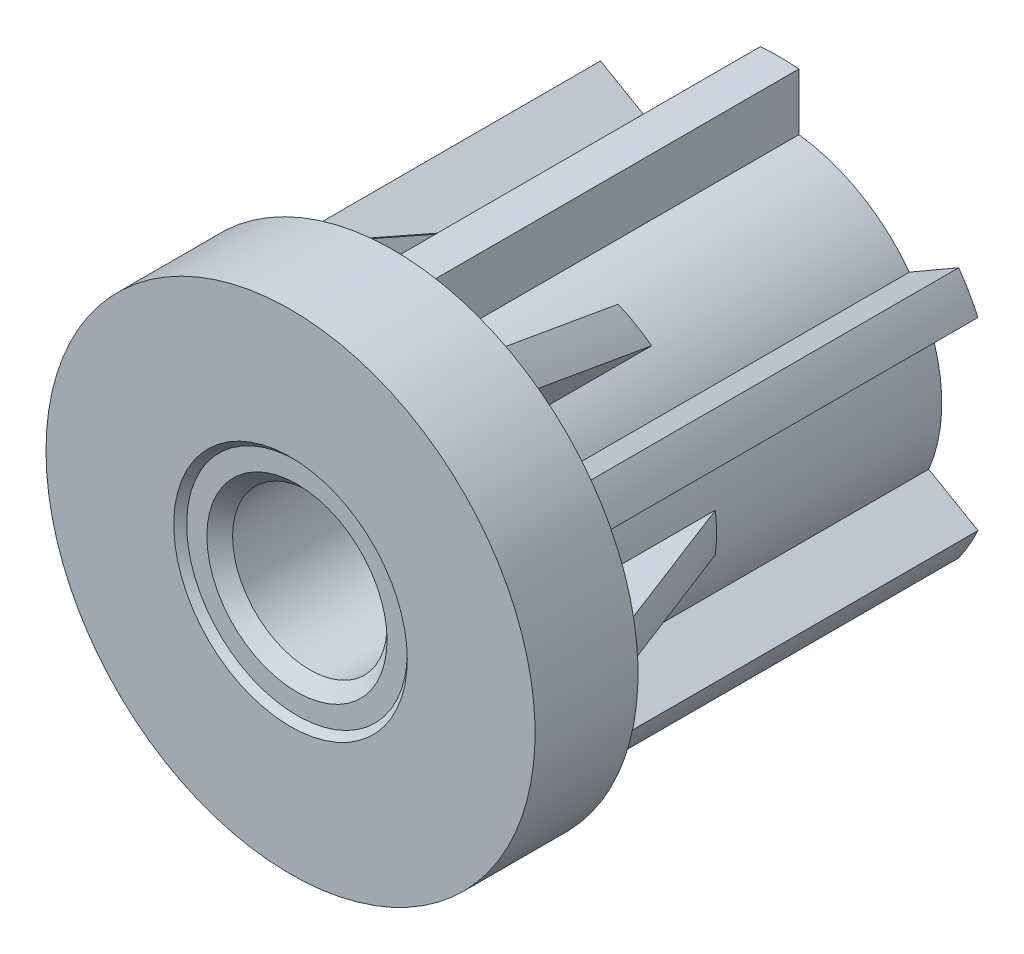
ISO-10303-21;
HEADER;
FILE_DESCRIPTION(('STEP AP214'),'2;1');
FILE_NAME('part.step','',(''),(''),'','','');
FILE_SCHEMA(('AUTOMOTIVE_DESIGN { 1 0 10303 214 1 1 1 1 }'));
ENDSEC;
DATA;
#1=APPLICATION_CONTEXT('core data for automotive mechanical design processes');
#2=APPLICATION_PROTOCOL_DEFINITION('international standard','automotive_design',2000,#1);
#3=PRODUCT_CONTEXT('',#1,'mechanical');
#4=PRODUCT('Part','Part','',(#3));
#5=PRODUCT_RELATED_PRODUCT_CATEGORY('part','',(#4));
#6=PRODUCT_DEFINITION_FORMATION('','',#4);
#7=PRODUCT_DEFINITION_CONTEXT('part definition',#1,'design');
#8=PRODUCT_DEFINITION('design','',#6,#7);
#9=PRODUCT_DEFINITION_SHAPE('','',#8);
#10=(LENGTH_UNIT() NAMED_UNIT(*) SI_UNIT(.MILLI.,.METRE.));
#11=(NAMED_UNIT(*) PLANE_ANGLE_UNIT() SI_UNIT($,.RADIAN.));
#12=(NAMED_UNIT(*) SI_UNIT($,.STERADIAN.) SOLID_ANGLE_UNIT());
#13=UNCERTAINTY_MEASURE_WITH_UNIT(LENGTH_MEASURE(1.E-05),#10,'distance_accuracy_value','');
#14=(GEOMETRIC_REPRESENTATION_CONTEXT(3) GLOBAL_UNCERTAINTY_ASSIGNED_CONTEXT((#13)) GLOBAL_UNIT_ASSIGNED_CONTEXT((#10,
#11,#12)) REPRESENTATION_CONTEXT('',''));
#15=CARTESIAN_POINT('',(0.,0.,0.));
#16=DIRECTION('',(0.,0.,1.));
#17=DIRECTION('',(1.,0.,0.));
#18=AXIS2_PLACEMENT_3D('',#15,#16,#17);
#19=CARTESIAN_POINT('',(0.,0.,-5.));
#20=DIRECTION('',(0.,0.,-1.));
#21=DIRECTION('',(-1.,0.,0.));
#22=AXIS2_PLACEMENT_3D('',#19,#20,#21);
#23=CYLINDRICAL_SURFACE('',#22,7.25);
#24=CARTESIAN_POINT('',(0.,0.,-8.));
#25=DIRECTION('',(0.,0.,-1.));
#26=DIRECTION('',(-1.,0.,0.));
#27=AXIS2_PLACEMENT_3D('',#24,#25,#26);
#28=CIRCLE('',#27,7.25);
#29=CARTESIAN_POINT('',(-7.25,0.,-8.));
#30=VERTEX_POINT('',#29);
#31=EDGE_CURVE('E1473',#30,#30,#28,.T.);
#32=ORIENTED_EDGE('',*,*,#31,.T.);
#33=EDGE_LOOP('',(#32));
#34=FACE_BOUND('',#33,.T.);
#35=CARTESIAN_POINT('',(0.,0.,-2.));
#36=DIRECTION('',(0.,0.,-1.));
#37=DIRECTION('',(-1.,0.,0.));
#38=AXIS2_PLACEMENT_3D('',#35,#36,#37);
#39=CIRCLE('',#38,7.25);
#40=CARTESIAN_POINT('',(-7.25,0.,-2.));
#41=VERTEX_POINT('',#40);
#42=EDGE_CURVE('E1478',#41,#41,#39,.F.);
#43=ORIENTED_EDGE('',*,*,#42,.T.);
#44=EDGE_LOOP('',(#43));
#45=FACE_BOUND('',#44,.T.);
#46=ADVANCED_FACE('F14',(#34,#45),#23,.F.);
#47=CARTESIAN_POINT('',(0.,6.625,-2.));
#48=DIRECTION('',(0.,0.,1.));
#49=DIRECTION('',(1.,0.,0.));
#50=AXIS2_PLACEMENT_3D('',#47,#48,#49);
#51=PLANE('',#50);
#52=ORIENTED_EDGE('',*,*,#42,.F.);
#53=EDGE_LOOP('',(#52));
#54=FACE_BOUND('',#53,.T.);
#55=CARTESIAN_POINT('',(0.,0.,-1.9999999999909));
#56=DIRECTION('',(0.,0.,-1.));
#57=DIRECTION('',(-1.,0.,0.));
#58=AXIS2_PLACEMENT_3D('',#55,#56,#57);
#59=CIRCLE('',#58,5.99999999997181);
#60=CARTESIAN_POINT('',(-5.99999999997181,0.,-1.9999999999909));
#61=VERTEX_POINT('',#60);
#62=EDGE_CURVE('E1471',#61,#61,#59,.F.);
#63=ORIENTED_EDGE('',*,*,#62,.T.);
#64=EDGE_LOOP('',(#63));
#65=FACE_BOUND('',#64,.T.);
#66=ADVANCED_FACE('F1398',(#54,#65),#51,.F.);
#67=CARTESIAN_POINT('',(0.,7.875,-8.));
#68=DIRECTION('',(0.,0.,1.));
#69=DIRECTION('',(1.,0.,0.));
#70=AXIS2_PLACEMENT_3D('',#67,#68,#69);
#71=PLANE('',#70);
#72=CARTESIAN_POINT('',(0.,0.,-8.));
#73=DIRECTION('',(0.,0.,-1.));
#74=DIRECTION('',(-1.,0.,0.));
#75=AXIS2_PLACEMENT_3D('',#72,#73,#74);
#76=CIRCLE('',#75,8.5);
#77=CARTESIAN_POINT('',(-8.5,0.,-8.));
#78=VERTEX_POINT('',#77);
#79=EDGE_CURVE('E1468',#78,#78,#76,.T.);
#80=ORIENTED_EDGE('',*,*,#79,.T.);
#81=EDGE_LOOP('',(#80));
#82=FACE_BOUND('',#81,.T.);
#83=ORIENTED_EDGE('',*,*,#31,.F.);
#84=EDGE_LOOP('',(#83));
#85=FACE_BOUND('',#84,.T.);
#86=ADVANCED_FACE('F1407',(#82,#85),#71,.F.);
#87=CARTESIAN_POINT('',(0.,0.,-19.));
#88=DIRECTION('',(0.,0.,-1.));
#89=DIRECTION('',(-1.,0.,0.));
#90=AXIS2_PLACEMENT_3D('',#87,#88,#89);
#91=CYLINDRICAL_SURFACE('',#90,8.5);
#92=ORIENTED_EDGE('',*,*,#79,.F.);
#93=EDGE_LOOP('',(#92));
#94=FACE_BOUND('',#93,.T.);
#95=CARTESIAN_POINT('',(0.,0.,-30.));
#96=DIRECTION('',(0.,0.,-1.));
#97=DIRECTION('',(-1.,0.,0.));
#98=AXIS2_PLACEMENT_3D('',#95,#96,#97);
#99=CIRCLE('',#98,8.5);
#100=CARTESIAN_POINT('',(-8.5,0.,-30.));
#101=VERTEX_POINT('',#100);
#102=EDGE_CURVE('E694',#101,#101,#99,.F.);
#103=ORIENTED_EDGE('',*,*,#102,.F.);
#104=EDGE_LOOP('',(#103));
#105=FACE_BOUND('',#104,.T.);
#106=ADVANCED_FACE('F1417',(#94,#105),#91,.F.);
#107=CARTESIAN_POINT('',(0.,0.,-1.));
#108=DIRECTION('',(0.,0.,1.));
#109=DIRECTION('',(1.,0.,0.));
#110=AXIS2_PLACEMENT_3D('',#107,#108,#109);
#111=CONICAL_SURFACE('',#110,17.,0.365424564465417);
#112=CARTESIAN_POINT('',(-16.9336942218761,-1.5,-1.));
#113=CARTESIAN_POINT('',(-16.5655249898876,-1.5,-1.95850213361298));
#114=CARTESIAN_POINT('',(-16.197277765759,-1.5,-2.9169743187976));
#115=CARTESIAN_POINT('',(-15.4605829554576,-1.5,-4.83384160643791));
#116=CARTESIAN_POINT('',(-15.0921353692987,-1.5,-5.79223670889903));
#117=CARTESIAN_POINT('',(-14.3549953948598,-1.5,-7.70893280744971));
#118=CARTESIAN_POINT('',(-13.9863030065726,-1.5,-8.66723380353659));
#119=CARTESIAN_POINT('',(-13.2486031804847,-1.5,-10.5837145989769));
#120=CARTESIAN_POINT('',(-12.8795957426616,-1.5,-11.5418943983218));
#121=CARTESIAN_POINT('',(-12.5103956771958,-1.5,-12.5));
#122=B_SPLINE_CURVE_WITH_KNOTS('',3,(#112,#113,#114,#115,#116,#117,#118,#119,#120,#121),
.UNSPECIFIED.,.F.,.F.,(4,2,2,2,4),(0.,3.08033672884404,6.16067324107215,9.24100984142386,
12.3213466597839),.UNSPECIFIED.);
#123=CARTESIAN_POINT('',(-16.9336942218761,-1.5,-1.));
#124=VERTEX_POINT('',#123);
#125=CARTESIAN_POINT('',(-12.5103956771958,-1.5,-12.5));
#126=VERTEX_POINT('',#125);
#127=EDGE_CURVE('E683',#124,#126,#122,.T.);
#128=ORIENTED_EDGE('',*,*,#127,.F.);
#129=CARTESIAN_POINT('',(-1.88264912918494E-13,1.02140518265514E-13,-1.));
#130=DIRECTION('',(0.,0.,1.));
#131=DIRECTION('',(1.,0.,0.));
#132=AXIS2_PLACEMENT_3D('',#129,#130,#131);
#133=CIRCLE('',#132,17.);
#134=CARTESIAN_POINT('',(-16.9336942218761,1.5,-1.));
#135=VERTEX_POINT('',#134);
#136=EDGE_CURVE('E323',#135,#124,#133,.T.);
#137=ORIENTED_EDGE('',*,*,#136,.F.);
#138=CARTESIAN_POINT('',(-12.5103956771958,1.5,-12.5));
#139=CARTESIAN_POINT('',(-12.8795957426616,1.5,-11.5418943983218));
#140=CARTESIAN_POINT('',(-13.2486031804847,1.5,-10.5837145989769));
#141=CARTESIAN_POINT('',(-13.9863030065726,1.5,-8.66723380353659));
#142=CARTESIAN_POINT('',(-14.3549953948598,1.5,-7.70893280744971));
#143=CARTESIAN_POINT('',(-15.0921353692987,1.5,-5.79223670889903));
#144=CARTESIAN_POINT('',(-15.4605829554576,1.5,-4.83384160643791));
#145=CARTESIAN_POINT('',(-16.197277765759,1.5,-2.9169743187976));
#146=CARTESIAN_POINT('',(-16.5655249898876,1.5,-1.95850213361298));
#147=CARTESIAN_POINT('',(-16.9336942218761,1.5,-1.));
#148=B_SPLINE_CURVE_WITH_KNOTS('',3,(#138,#139,#140,#141,#142,#143,#144,#145,#146,#147),
.UNSPECIFIED.,.F.,.F.,(4,2,2,2,4),(0.,3.08033681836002,6.16067341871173,9.24100993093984,
12.3213466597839),.UNSPECIFIED.);
#149=CARTESIAN_POINT('',(-12.5103956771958,1.5,-12.5));
#150=VERTEX_POINT('',#149);
#151=EDGE_CURVE('E316',#150,#135,#148,.T.);
#152=ORIENTED_EDGE('',*,*,#151,.F.);
#153=CARTESIAN_POINT('',(0.,0.,-12.5));
#154=DIRECTION('',(0.,0.,-1.));
#155=DIRECTION('',(-1.,0.,0.));
#156=AXIS2_PLACEMENT_3D('',#153,#154,#155);
#157=CIRCLE('',#156,12.6);
#158=EDGE_CURVE('E320',#126,#150,#157,.T.);
#159=ORIENTED_EDGE('',*,*,#158,.F.);
#160=EDGE_LOOP('',(#128,#137,#152,#159));
#161=FACE_BOUND('',#160,.T.);
#162=ADVANCED_FACE('F318',(#161),#111,.T.);
#163=CARTESIAN_POINT('',(0.,0.,-1.));
#164=DIRECTION('',(0.,0.,1.));
#165=DIRECTION('',(1.,0.,0.));
#166=AXIS2_PLACEMENT_3D('',#163,#164,#165);
#167=CONICAL_SURFACE('',#166,17.,0.365424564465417);
#168=CARTESIAN_POINT('',(-7.16780900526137,-15.4150093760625,-1.));
#169=CARTESIAN_POINT('',(-6.98372438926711,-15.0961654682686,-1.95850213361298));
#170=CARTESIAN_POINT('',(-6.79960077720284,-14.7772540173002,-2.91697431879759));
#171=CARTESIAN_POINT('',(-6.43125337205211,-14.139257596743,-4.83384160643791));
#172=CARTESIAN_POINT('',(-6.2470295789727,-13.8201726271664,-5.79223670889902));
#173=CARTESIAN_POINT('',(-5.87845959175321,-13.1817906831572,-7.70893280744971));
#174=CARTESIAN_POINT('',(-5.69411339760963,-12.8624937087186,-8.66723380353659));
#175=CARTESIAN_POINT('',(-5.32526348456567,-12.2236269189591,-10.5837145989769));
#176=CARTESIAN_POINT('',(-5.14075976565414,-11.9040571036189,-11.5418943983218));
#177=CARTESIAN_POINT('',(-4.95615973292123,-11.5843204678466,-12.5));
#178=B_SPLINE_CURVE_WITH_KNOTS('',3,(#168,#169,#170,#171,#172,#173,#174,#175,#176,#177),
.UNSPECIFIED.,.F.,.F.,(4,2,2,2,4),(0.,3.08033672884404,6.16067324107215,9.24100984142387,
12.3213466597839),.UNSPECIFIED.);
#179=CARTESIAN_POINT('',(-7.16780900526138,-15.4150093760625,-1.));
#180=VERTEX_POINT('',#179);
#181=CARTESIAN_POINT('',(-4.95615973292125,-11.5843204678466,-12.5));
#182=VERTEX_POINT('',#181);
#183=EDGE_CURVE('E634',#180,#182,#178,.T.);
#184=ORIENTED_EDGE('',*,*,#183,.F.);
#185=CARTESIAN_POINT('',(-4.35178513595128E-13,-7.99360577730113E-13,-1.));
#186=DIRECTION('',(0.,0.,1.));
#187=DIRECTION('',(1.,0.,0.));
#188=AXIS2_PLACEMENT_3D('',#185,#186,#187);
#189=CIRCLE('',#188,16.9999999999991);
#190=CARTESIAN_POINT('',(-9.7658852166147,-13.9150093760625,-1.));
#191=VERTEX_POINT('',#190);
#192=EDGE_CURVE('E650',#191,#180,#189,.T.);
#193=ORIENTED_EDGE('',*,*,#192,.F.);
#194=CARTESIAN_POINT('',(-7.55423594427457,-10.0843204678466,-12.5));
#195=CARTESIAN_POINT('',(-7.73883597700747,-10.4040571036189,-11.5418943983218));
#196=CARTESIAN_POINT('',(-7.923339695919,-10.723626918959,-10.5837145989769));
#197=CARTESIAN_POINT('',(-8.29218960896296,-11.3624937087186,-8.6672338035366));
#198=CARTESIAN_POINT('',(-8.47653580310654,-11.6817906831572,-7.70893280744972));
#199=CARTESIAN_POINT('',(-8.84510579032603,-12.3201726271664,-5.79223670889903));
#200=CARTESIAN_POINT('',(-9.02932958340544,-12.6392575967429,-4.83384160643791));
#201=CARTESIAN_POINT('',(-9.39767698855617,-13.2772540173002,-2.9169743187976));
#202=CARTESIAN_POINT('',(-9.58180060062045,-13.5961654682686,-1.95850213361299));
#203=CARTESIAN_POINT('',(-9.76588521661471,-13.9150093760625,-1.));
#204=B_SPLINE_CURVE_WITH_KNOTS('',3,(#194,#195,#196,#197,#198,#199,#200,#201,#202,#203),
.UNSPECIFIED.,.F.,.F.,(4,2,2,2,4),(0.,3.08033681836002,6.16067341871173,9.24100993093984,
12.3213466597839),.UNSPECIFIED.);
#205=CARTESIAN_POINT('',(-7.55423594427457,-10.0843204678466,-12.5));
#206=VERTEX_POINT('',#205);
#207=EDGE_CURVE('E642',#206,#191,#204,.T.);
#208=ORIENTED_EDGE('',*,*,#207,.F.);
#209=CARTESIAN_POINT('',(0.,0.,-12.5));
#210=DIRECTION('',(0.,0.,-1.));
#211=DIRECTION('',(-1.,0.,0.));
#212=AXIS2_PLACEMENT_3D('',#209,#210,#211);
#213=CIRCLE('',#212,12.6);
#214=EDGE_CURVE('E855',#182,#206,#213,.T.);
#215=ORIENTED_EDGE('',*,*,#214,.F.);
#216=EDGE_LOOP('',(#184,#193,#208,#215));
#217=FACE_BOUND('',#216,.T.);
#218=ADVANCED_FACE('F623',(#217),#167,.T.);
#219=CARTESIAN_POINT('',(0.,0.,-1.));
#220=DIRECTION('',(0.,0.,1.));
#221=DIRECTION('',(1.,0.,0.));
#222=AXIS2_PLACEMENT_3D('',#219,#220,#221);
#223=CONICAL_SURFACE('',#222,17.,0.365424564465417);
#224=CARTESIAN_POINT('',(9.76588521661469,-13.9150093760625,-1.));
#225=CARTESIAN_POINT('',(9.58180060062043,-13.5961654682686,-1.95850213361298));
#226=CARTESIAN_POINT('',(9.39767698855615,-13.2772540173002,-2.9169743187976));
#227=CARTESIAN_POINT('',(9.02932958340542,-12.639257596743,-4.83384160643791));
#228=CARTESIAN_POINT('',(8.84510579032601,-12.3201726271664,-5.79223670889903));
#229=CARTESIAN_POINT('',(8.47653580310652,-11.6817906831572,-7.70893280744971));
#230=CARTESIAN_POINT('',(8.29218960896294,-11.3624937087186,-8.66723380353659));
#231=CARTESIAN_POINT('',(7.92333969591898,-10.7236269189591,-10.5837145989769));
#232=CARTESIAN_POINT('',(7.73883597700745,-10.4040571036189,-11.5418943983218));
#233=CARTESIAN_POINT('',(7.55423594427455,-10.0843204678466,-12.5));
#234=B_SPLINE_CURVE_WITH_KNOTS('',3,(#224,#225,#226,#227,#228,#229,#230,#231,#232,#233),
.UNSPECIFIED.,.F.,.F.,(4,2,2,2,4),(0.,3.08033672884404,6.16067324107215,9.24100984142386,
12.3213466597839),.UNSPECIFIED.);
#235=CARTESIAN_POINT('',(9.76588521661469,-13.9150093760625,-1.));
#236=VERTEX_POINT('',#235);
#237=CARTESIAN_POINT('',(7.55423594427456,-10.0843204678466,-12.5));
#238=VERTEX_POINT('',#237);
#239=EDGE_CURVE('E604',#236,#238,#234,.T.);
#240=ORIENTED_EDGE('',*,*,#239,.F.);
#241=CARTESIAN_POINT('',(0.,0.,-1.));
#242=DIRECTION('',(0.,0.,1.));
#243=DIRECTION('',(1.,0.,0.));
#244=AXIS2_PLACEMENT_3D('',#241,#242,#243);
#245=CIRCLE('',#244,17.);
#246=CARTESIAN_POINT('',(7.16780900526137,-15.4150093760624,-1.));
#247=VERTEX_POINT('',#246);
#248=EDGE_CURVE('E835',#247,#236,#245,.T.);
#249=ORIENTED_EDGE('',*,*,#248,.F.);
#250=CARTESIAN_POINT('',(4.95615973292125,-11.5843204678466,-12.5));
#251=CARTESIAN_POINT('',(5.14075976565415,-11.9040571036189,-11.5418943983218));
#252=CARTESIAN_POINT('',(5.32526348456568,-12.223626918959,-10.5837145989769));
#253=CARTESIAN_POINT('',(5.69411339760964,-12.8624937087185,-8.6672338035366));
#254=CARTESIAN_POINT('',(5.87845959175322,-13.1817906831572,-7.70893280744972));
#255=CARTESIAN_POINT('',(6.24702957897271,-13.8201726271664,-5.79223670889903));
#256=CARTESIAN_POINT('',(6.43125337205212,-14.139257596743,-4.83384160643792));
#257=CARTESIAN_POINT('',(6.79960077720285,-14.7772540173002,-2.9169743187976));
#258=CARTESIAN_POINT('',(6.98372438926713,-15.0961654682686,-1.95850213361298));
#259=CARTESIAN_POINT('',(7.16780900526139,-15.4150093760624,-1.));
#260=B_SPLINE_CURVE_WITH_KNOTS('',3,(#250,#251,#252,#253,#254,#255,#256,#257,#258,#259),
.UNSPECIFIED.,.F.,.F.,(4,2,2,2,4),(0.,3.08033681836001,6.16067341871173,9.24100993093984,
12.3213466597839),.UNSPECIFIED.);
#261=CARTESIAN_POINT('',(4.95615973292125,-11.5843204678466,-12.5));
#262=VERTEX_POINT('',#261);
#263=EDGE_CURVE('E613',#262,#247,#260,.T.);
#264=ORIENTED_EDGE('',*,*,#263,.F.);
#265=CARTESIAN_POINT('',(0.,0.,-12.5));
#266=DIRECTION('',(0.,0.,-1.));
#267=DIRECTION('',(-1.,0.,0.));
#268=AXIS2_PLACEMENT_3D('',#265,#266,#267);
#269=CIRCLE('',#268,12.6);
#270=EDGE_CURVE('E829',#238,#262,#269,.T.);
#271=ORIENTED_EDGE('',*,*,#270,.F.);
#272=EDGE_LOOP('',(#240,#249,#264,#271));
#273=FACE_BOUND('',#272,.T.);
#274=ADVANCED_FACE('F619',(#273),#223,.T.);
#275=CARTESIAN_POINT('',(0.,0.,-0.99999999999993));
#276=DIRECTION('',(0.,0.,1.));
#277=DIRECTION('',(1.,0.,0.));
#278=AXIS2_PLACEMENT_3D('',#275,#276,#277);
#279=CONICAL_SURFACE('',#278,17.,0.365424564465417);
#280=CARTESIAN_POINT('',(12.5103956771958,-1.5,-12.5));
#281=CARTESIAN_POINT('',(12.8795957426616,-1.5,-11.5418943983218));
#282=CARTESIAN_POINT('',(13.2486031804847,-1.5,-10.5837145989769));
#283=CARTESIAN_POINT('',(13.9863030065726,-1.5,-8.66723380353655));
#284=CARTESIAN_POINT('',(14.3549953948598,-1.5,-7.70893280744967));
#285=CARTESIAN_POINT('',(15.0921353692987,-1.5,-5.79223670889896));
#286=CARTESIAN_POINT('',(15.4605829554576,-1.5,-4.83384160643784));
#287=CARTESIAN_POINT('',(16.197277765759,-1.5,-2.91697431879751));
#288=CARTESIAN_POINT('',(16.5655249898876,-1.5,-1.9585021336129));
#289=CARTESIAN_POINT('',(16.9336942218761,-1.5,-0.999999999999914));
#290=B_SPLINE_CURVE_WITH_KNOTS('',3,(#280,#281,#282,#283,#284,#285,#286,#287,#288,#289),
.UNSPECIFIED.,.F.,.F.,(4,2,2,2,4),(0.,3.08033681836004,6.16067341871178,9.24100993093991,
12.321346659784),.UNSPECIFIED.);
#291=CARTESIAN_POINT('',(12.5103956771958,-1.5,-12.5));
#292=VERTEX_POINT('',#291);
#293=CARTESIAN_POINT('',(16.9336942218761,-1.5,-0.999999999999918));
#294=VERTEX_POINT('',#293);
#295=EDGE_CURVE('E564',#292,#294,#290,.T.);
#296=ORIENTED_EDGE('',*,*,#295,.F.);
#297=CARTESIAN_POINT('',(0.,0.,-12.5));
#298=DIRECTION('',(0.,0.,-1.));
#299=DIRECTION('',(-1.,0.,0.));
#300=AXIS2_PLACEMENT_3D('',#297,#298,#299);
#301=CIRCLE('',#300,12.6);
#302=CARTESIAN_POINT('',(12.5103956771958,1.5,-12.5));
#303=VERTEX_POINT('',#302);
#304=EDGE_CURVE('E805',#303,#292,#301,.T.);
#305=ORIENTED_EDGE('',*,*,#304,.F.);
#306=CARTESIAN_POINT('',(16.9336942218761,1.5,-0.999999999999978));
#307=CARTESIAN_POINT('',(16.5655249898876,1.5,-1.95850213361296));
#308=CARTESIAN_POINT('',(16.197277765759,1.5,-2.91697431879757));
#309=CARTESIAN_POINT('',(15.4605829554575,1.5,-4.83384160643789));
#310=CARTESIAN_POINT('',(15.0921353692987,1.5,-5.79223670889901));
#311=CARTESIAN_POINT('',(14.3549953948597,1.5,-7.7089328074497));
#312=CARTESIAN_POINT('',(13.9863030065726,1.5,-8.66723380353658));
#313=CARTESIAN_POINT('',(13.2486031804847,1.5,-10.5837145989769));
#314=CARTESIAN_POINT('',(12.8795957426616,1.5,-11.5418943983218));
#315=CARTESIAN_POINT('',(12.5103956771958,1.5,-12.5));
#316=B_SPLINE_CURVE_WITH_KNOTS('',3,(#306,#307,#308,#309,#310,#311,#312,#313,#314,#315),
.UNSPECIFIED.,.F.,.F.,(4,2,2,2,4),(0.,3.08033672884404,6.16067324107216,9.24100984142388,
12.3213466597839),.UNSPECIFIED.);
#317=CARTESIAN_POINT('',(16.9336942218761,1.5,-0.999999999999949));
#318=VERTEX_POINT('',#317);
#319=EDGE_CURVE('E555',#318,#303,#316,.T.);
#320=ORIENTED_EDGE('',*,*,#319,.F.);
#321=CARTESIAN_POINT('',(1.67006454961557E-13,-1.96509475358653E-13,-0.999999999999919));
#322=DIRECTION('',(0.,0.,1.));
#323=DIRECTION('',(1.,0.,0.));
#324=AXIS2_PLACEMENT_3D('',#321,#322,#323);
#325=CIRCLE('',#324,17.);
#326=EDGE_CURVE('E571',#294,#318,#325,.T.);
#327=ORIENTED_EDGE('',*,*,#326,.F.);
#328=EDGE_LOOP('',(#296,#305,#320,#327));
#329=FACE_BOUND('',#328,.T.);
#330=ADVANCED_FACE('F498',(#329),#279,.T.);
#331=CARTESIAN_POINT('',(0.,0.,-1.));
#332=DIRECTION('',(0.,0.,1.));
#333=DIRECTION('',(1.,0.,0.));
#334=AXIS2_PLACEMENT_3D('',#331,#332,#333);
#335=CONICAL_SURFACE('',#334,17.,0.365424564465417);
#336=CARTESIAN_POINT('',(7.16780900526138,15.4150093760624,-0.999999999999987));
#337=CARTESIAN_POINT('',(6.98372438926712,15.0961654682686,-1.95850213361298));
#338=CARTESIAN_POINT('',(6.79960077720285,14.7772540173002,-2.91697431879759));
#339=CARTESIAN_POINT('',(6.43125337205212,14.139257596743,-4.83384160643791));
#340=CARTESIAN_POINT('',(6.2470295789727,13.8201726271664,-5.79223670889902));
#341=CARTESIAN_POINT('',(5.87845959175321,13.1817906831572,-7.70893280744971));
#342=CARTESIAN_POINT('',(5.69411339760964,12.8624937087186,-8.66723380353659));
#343=CARTESIAN_POINT('',(5.32526348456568,12.2236269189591,-10.5837145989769));
#344=CARTESIAN_POINT('',(5.14075976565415,11.9040571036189,-11.5418943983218));
#345=CARTESIAN_POINT('',(4.95615973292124,11.5843204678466,-12.5));
#346=B_SPLINE_CURVE_WITH_KNOTS('',3,(#336,#337,#338,#339,#340,#341,#342,#343,#344,#345),
.UNSPECIFIED.,.F.,.F.,(4,2,2,2,4),(0.,3.08033672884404,6.16067324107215,9.24100984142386,
12.3213466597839),.UNSPECIFIED.);
#347=CARTESIAN_POINT('',(7.16780900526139,15.4150093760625,-1.));
#348=VERTEX_POINT('',#347);
#349=CARTESIAN_POINT('',(4.95615973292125,11.5843204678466,-12.5));
#350=VERTEX_POINT('',#349);
#351=EDGE_CURVE('E504',#348,#350,#346,.T.);
#352=ORIENTED_EDGE('',*,*,#351,.F.);
#353=CARTESIAN_POINT('',(-6.42124085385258E-13,-6.48370246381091E-13,-1.));
#354=DIRECTION('',(0.,0.,1.));
#355=DIRECTION('',(1.,0.,0.));
#356=AXIS2_PLACEMENT_3D('',#353,#354,#355);
#357=CIRCLE('',#356,17.0000000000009);
#358=CARTESIAN_POINT('',(9.76588521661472,13.9150093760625,-1.));
#359=VERTEX_POINT('',#358);
#360=EDGE_CURVE('E520',#359,#348,#357,.T.);
#361=ORIENTED_EDGE('',*,*,#360,.F.);
#362=CARTESIAN_POINT('',(7.55423594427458,10.0843204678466,-12.5));
#363=CARTESIAN_POINT('',(7.73883597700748,10.4040571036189,-11.5418943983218));
#364=CARTESIAN_POINT('',(7.92333969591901,10.723626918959,-10.5837145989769));
#365=CARTESIAN_POINT('',(8.29218960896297,11.3624937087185,-8.66723380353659));
#366=CARTESIAN_POINT('',(8.47653580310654,11.6817906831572,-7.70893280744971));
#367=CARTESIAN_POINT('',(8.84510579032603,12.3201726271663,-5.79223670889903));
#368=CARTESIAN_POINT('',(9.02932958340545,12.6392575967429,-4.83384160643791));
#369=CARTESIAN_POINT('',(9.39767698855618,13.2772540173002,-2.9169743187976));
#370=CARTESIAN_POINT('',(9.58180060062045,13.5961654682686,-1.95850213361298));
#371=CARTESIAN_POINT('',(9.76588521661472,13.9150093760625,-1.));
#372=B_SPLINE_CURVE_WITH_KNOTS('',3,(#362,#363,#364,#365,#366,#367,#368,#369,#370,#371),
.UNSPECIFIED.,.F.,.F.,(4,2,2,2,4),(0.,3.08033681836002,6.16067341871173,9.24100993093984,
12.3213466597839),.UNSPECIFIED.);
#373=CARTESIAN_POINT('',(7.55423594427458,10.0843204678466,-12.5));
#374=VERTEX_POINT('',#373);
#375=EDGE_CURVE('E512',#374,#359,#372,.T.);
#376=ORIENTED_EDGE('',*,*,#375,.F.);
#377=CARTESIAN_POINT('',(0.,0.,-12.5));
#378=DIRECTION('',(0.,0.,-1.));
#379=DIRECTION('',(-1.,0.,0.));
#380=AXIS2_PLACEMENT_3D('',#377,#378,#379);
#381=CIRCLE('',#380,12.6);
#382=EDGE_CURVE('E780',#350,#374,#381,.T.);
#383=ORIENTED_EDGE('',*,*,#382,.F.);
#384=EDGE_LOOP('',(#352,#361,#376,#383));
#385=FACE_BOUND('',#384,.T.);
#386=ADVANCED_FACE('F491',(#385),#335,.T.);
#387=CARTESIAN_POINT('',(0.,0.,-1.));
#388=DIRECTION('',(0.,0.,1.));
#389=DIRECTION('',(1.,0.,0.));
#390=AXIS2_PLACEMENT_3D('',#387,#388,#389);
#391=CONICAL_SURFACE('',#390,17.,0.365424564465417);
#392=CARTESIAN_POINT('',(-9.7658852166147,13.9150093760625,-1.));
#393=CARTESIAN_POINT('',(-9.58180060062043,13.5961654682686,-1.95850213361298));
#394=CARTESIAN_POINT('',(-9.39767698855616,13.2772540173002,-2.91697431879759));
#395=CARTESIAN_POINT('',(-9.02932958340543,12.639257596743,-4.83384160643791));
#396=CARTESIAN_POINT('',(-8.84510579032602,12.3201726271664,-5.79223670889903));
#397=CARTESIAN_POINT('',(-8.47653580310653,11.6817906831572,-7.70893280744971));
#398=CARTESIAN_POINT('',(-8.29218960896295,11.3624937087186,-8.66723380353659));
#399=CARTESIAN_POINT('',(-7.92333969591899,10.7236269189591,-10.5837145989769));
#400=CARTESIAN_POINT('',(-7.73883597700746,10.4040571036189,-11.5418943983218));
#401=CARTESIAN_POINT('',(-7.55423594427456,10.0843204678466,-12.5));
#402=B_SPLINE_CURVE_WITH_KNOTS('',3,(#392,#393,#394,#395,#396,#397,#398,#399,#400,#401),
.UNSPECIFIED.,.F.,.F.,(4,2,2,2,4),(0.,3.08033672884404,6.16067324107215,9.24100984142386,
12.3213466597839),.UNSPECIFIED.);
#403=CARTESIAN_POINT('',(-9.7658852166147,13.9150093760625,-1.));
#404=VERTEX_POINT('',#403);
#405=CARTESIAN_POINT('',(-7.55423594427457,10.0843204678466,-12.5));
#406=VERTEX_POINT('',#405);
#407=EDGE_CURVE('E464',#404,#406,#402,.T.);
#408=ORIENTED_EDGE('',*,*,#407,.F.);
#409=CARTESIAN_POINT('',(-2.326738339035E-13,1.11910480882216E-13,-1.));
#410=DIRECTION('',(0.,0.,1.));
#411=DIRECTION('',(1.,0.,0.));
#412=AXIS2_PLACEMENT_3D('',#409,#410,#411);
#413=CIRCLE('',#412,17.);
#414=CARTESIAN_POINT('',(-7.16780900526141,15.4150093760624,-1.));
#415=VERTEX_POINT('',#414);
#416=EDGE_CURVE('E888',#415,#404,#413,.T.);
#417=ORIENTED_EDGE('',*,*,#416,.F.);
#418=CARTESIAN_POINT('',(-4.95615973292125,11.5843204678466,-12.5));
#419=CARTESIAN_POINT('',(-5.14075976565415,11.9040571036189,-11.5418943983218));
#420=CARTESIAN_POINT('',(-5.32526348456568,12.223626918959,-10.5837145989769));
#421=CARTESIAN_POINT('',(-5.69411339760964,12.8624937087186,-8.6672338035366));
#422=CARTESIAN_POINT('',(-5.87845959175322,13.1817906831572,-7.70893280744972));
#423=CARTESIAN_POINT('',(-6.24702957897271,13.8201726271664,-5.79223670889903));
#424=CARTESIAN_POINT('',(-6.43125337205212,14.139257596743,-4.83384160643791));
#425=CARTESIAN_POINT('',(-6.79960077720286,14.7772540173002,-2.9169743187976));
#426=CARTESIAN_POINT('',(-6.98372438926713,15.0961654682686,-1.95850213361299));
#427=CARTESIAN_POINT('',(-7.1678090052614,15.4150093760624,-1.));
#428=B_SPLINE_CURVE_WITH_KNOTS('',3,(#418,#419,#420,#421,#422,#423,#424,#425,#426,#427),
.UNSPECIFIED.,.F.,.F.,(4,2,2,2,4),(0.,3.08033681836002,6.16067341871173,9.24100993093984,
12.3213466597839),.UNSPECIFIED.);
#429=CARTESIAN_POINT('',(-4.95615973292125,11.5843204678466,-12.5));
#430=VERTEX_POINT('',#429);
#431=EDGE_CURVE('E474',#430,#415,#428,.T.);
#432=ORIENTED_EDGE('',*,*,#431,.F.);
#433=CARTESIAN_POINT('',(0.,0.,-12.5));
#434=DIRECTION('',(0.,0.,-1.));
#435=DIRECTION('',(-1.,0.,0.));
#436=AXIS2_PLACEMENT_3D('',#433,#434,#435);
#437=CIRCLE('',#436,12.6);
#438=EDGE_CURVE('E760',#406,#430,#437,.T.);
#439=ORIENTED_EDGE('',*,*,#438,.F.);
#440=EDGE_LOOP('',(#408,#417,#432,#439));
#441=FACE_BOUND('',#440,.T.);
#442=ADVANCED_FACE('F485',(#441),#391,.T.);
#443=CARTESIAN_POINT('',(0.,6.3,-30.));
#444=DIRECTION('',(0.,0.,-1.));
#445=DIRECTION('',(-1.,0.,0.));
#446=AXIS2_PLACEMENT_3D('',#443,#444,#445);
#447=PLANE('',#446);
#448=ORIENTED_EDGE('',*,*,#102,.T.);
#449=EDGE_LOOP('',(#448));
#450=FACE_BOUND('',#449,.T.);
#451=CARTESIAN_POINT('',(0.,0.,-30.));
#452=DIRECTION('',(0.,0.,1.));
#453=DIRECTION('',(1.,0.,0.));
#454=AXIS2_PLACEMENT_3D('',#451,#452,#453);
#455=CIRCLE('',#454,17.);
#456=CARTESIAN_POINT('',(-13.9150093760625,9.7658852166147,-30.));
#457=VERTEX_POINT('',#456);
#458=CARTESIAN_POINT('',(-15.4150093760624,7.16780900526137,-30.));
#459=VERTEX_POINT('',#458);
#460=EDGE_CURVE('E456',#457,#459,#455,.T.);
#461=ORIENTED_EDGE('',*,*,#460,.F.);
#462=DIRECTION('',(0.866025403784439,-0.5,0.));
#463=VECTOR('',#462,1.);
#464=CARTESIAN_POINT('',(-6.9352130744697,5.73609794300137,-30.));
#465=LINE('',#464,#463);
#466=CARTESIAN_POINT('',(-10.0843204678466,7.55423594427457,-30.));
#467=VERTEX_POINT('',#466);
#468=EDGE_CURVE('E882',#467,#457,#465,.F.);
#469=ORIENTED_EDGE('',*,*,#468,.F.);
#470=CARTESIAN_POINT('',(0.,0.,-30.));
#471=DIRECTION('',(0.,0.,-1.));
#472=DIRECTION('',(-1.,0.,0.));
#473=AXIS2_PLACEMENT_3D('',#470,#471,#472);
#474=CIRCLE('',#473,12.6);
#475=CARTESIAN_POINT('',(-1.5,12.5103956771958,-30.));
#476=VERTEX_POINT('',#475);
#477=EDGE_CURVE('E460',#476,#467,#474,.F.);
#478=ORIENTED_EDGE('',*,*,#477,.F.);
#479=DIRECTION('',(0.,1.,0.));
#480=VECTOR('',#479,1.);
#481=CARTESIAN_POINT('',(-1.5,16.9336942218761,-30.));
#482=LINE('',#481,#480);
#483=CARTESIAN_POINT('',(-1.5,16.9336942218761,-30.));
#484=VERTEX_POINT('',#483);
#485=EDGE_CURVE('E767',#484,#476,#482,.F.);
#486=ORIENTED_EDGE('',*,*,#485,.F.);
#487=CARTESIAN_POINT('',(2.44450293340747E-13,6.32383034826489E-13,-30.));
#488=DIRECTION('',(0.,0.,1.));
#489=DIRECTION('',(1.,0.,0.));
#490=AXIS2_PLACEMENT_3D('',#487,#488,#489);
#491=CIRCLE('',#490,16.9999999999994);
#492=CARTESIAN_POINT('',(1.5,16.9336942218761,-30.));
#493=VERTEX_POINT('',#492);
#494=EDGE_CURVE('E768',#493,#484,#491,.T.);
#495=ORIENTED_EDGE('',*,*,#494,.F.);
#496=DIRECTION('',(0.,-1.,0.));
#497=VECTOR('',#496,1.);
#498=CARTESIAN_POINT('',(1.5,8.87411967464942,-30.));
#499=LINE('',#498,#497);
#500=CARTESIAN_POINT('',(1.5,12.5103956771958,-30.));
#501=VERTEX_POINT('',#500);
#502=EDGE_CURVE('E772',#501,#493,#499,.F.);
#503=ORIENTED_EDGE('',*,*,#502,.F.);
#504=CARTESIAN_POINT('',(0.,0.,-30.));
#505=DIRECTION('',(0.,0.,-1.));
#506=DIRECTION('',(-1.,0.,0.));
#507=AXIS2_PLACEMENT_3D('',#504,#505,#506);
#508=CIRCLE('',#507,12.6);
#509=CARTESIAN_POINT('',(10.0843204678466,7.55423594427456,-30.));
#510=VERTEX_POINT('',#509);
#511=EDGE_CURVE('E776',#510,#501,#508,.F.);
#512=ORIENTED_EDGE('',*,*,#511,.F.);
#513=DIRECTION('',(0.866025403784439,0.5,0.));
#514=VECTOR('',#513,1.);
#515=CARTESIAN_POINT('',(13.9150093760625,9.7658852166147,-30.));
#516=LINE('',#515,#514);
#517=CARTESIAN_POINT('',(13.9150093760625,9.7658852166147,-30.));
#518=VERTEX_POINT('',#517);
#519=EDGE_CURVE('E521',#518,#510,#516,.F.);
#520=ORIENTED_EDGE('',*,*,#519,.F.);
#521=CARTESIAN_POINT('',(5.35550770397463E-13,1.66977542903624E-13,-30.));
#522=DIRECTION('',(0.,0.,1.));
#523=DIRECTION('',(1.,0.,0.));
#524=AXIS2_PLACEMENT_3D('',#521,#522,#523);
#525=CIRCLE('',#524,16.9999999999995);
#526=CARTESIAN_POINT('',(15.4150093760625,7.1678090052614,-30.));
#527=VERTEX_POINT('',#526);
#528=EDGE_CURVE('E522',#527,#518,#525,.T.);
#529=ORIENTED_EDGE('',*,*,#528,.F.);
#530=DIRECTION('',(-0.866025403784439,-0.5,0.));
#531=VECTOR('',#530,1.);
#532=CARTESIAN_POINT('',(8.4352130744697,3.13802173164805,-30.));
#533=LINE('',#532,#531);
#534=CARTESIAN_POINT('',(11.5843204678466,4.95615973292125,-30.));
#535=VERTEX_POINT('',#534);
#536=EDGE_CURVE('E798',#535,#527,#533,.F.);
#537=ORIENTED_EDGE('',*,*,#536,.F.);
#538=CARTESIAN_POINT('',(0.,0.,-30.));
#539=DIRECTION('',(0.,0.,-1.));
#540=DIRECTION('',(-1.,0.,0.));
#541=AXIS2_PLACEMENT_3D('',#538,#539,#540);
#542=CIRCLE('',#541,12.6);
#543=CARTESIAN_POINT('',(11.5843204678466,-4.95615973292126,-30.));
#544=VERTEX_POINT('',#543);
#545=EDGE_CURVE('E563',#544,#535,#542,.F.);
#546=ORIENTED_EDGE('',*,*,#545,.F.);
#547=DIRECTION('',(0.866025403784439,-0.5,0.));
#548=VECTOR('',#547,1.);
#549=CARTESIAN_POINT('',(15.4150093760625,-7.1678090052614,-30.));
#550=LINE('',#549,#548);
#551=CARTESIAN_POINT('',(15.4150093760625,-7.1678090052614,-30.));
#552=VERTEX_POINT('',#551);
#553=EDGE_CURVE('E572',#552,#544,#550,.F.);
#554=ORIENTED_EDGE('',*,*,#553,.F.);
#555=CARTESIAN_POINT('',(1.80279402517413E-13,-1.35003119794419E-13,-30.));
#556=DIRECTION('',(0.,0.,1.));
#557=DIRECTION('',(1.,0.,0.));
#558=AXIS2_PLACEMENT_3D('',#555,#556,#557);
#559=CIRCLE('',#558,17.);
#560=CARTESIAN_POINT('',(13.9150093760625,-9.76588521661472,-30.));
#561=VERTEX_POINT('',#560);
#562=EDGE_CURVE('E573',#561,#552,#559,.T.);
#563=ORIENTED_EDGE('',*,*,#562,.F.);
#564=DIRECTION('',(-0.866025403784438,0.5,0.));
#565=VECTOR('',#564,1.);
#566=CARTESIAN_POINT('',(6.9352130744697,-5.73609794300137,-30.));
#567=LINE('',#566,#565);
#568=CARTESIAN_POINT('',(10.0843204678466,-7.55423594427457,-30.));
#569=VERTEX_POINT('',#568);
#570=EDGE_CURVE('E821',#569,#561,#567,.F.);
#571=ORIENTED_EDGE('',*,*,#570,.F.);
#572=CARTESIAN_POINT('',(0.,0.,-30.));
#573=DIRECTION('',(0.,0.,-1.));
#574=DIRECTION('',(-1.,0.,0.));
#575=AXIS2_PLACEMENT_3D('',#572,#573,#574);
#576=CIRCLE('',#575,12.6);
#577=CARTESIAN_POINT('',(1.5,-12.5103956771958,-30.));
#578=VERTEX_POINT('',#577);
#579=EDGE_CURVE('E612',#578,#569,#576,.F.);
#580=ORIENTED_EDGE('',*,*,#579,.F.);
#581=DIRECTION('',(0.,-1.,0.));
#582=VECTOR('',#581,1.);
#583=CARTESIAN_POINT('',(1.5,-16.9336942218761,-30.));
#584=LINE('',#583,#582);
#585=CARTESIAN_POINT('',(1.5,-16.9336942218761,-30.));
#586=VERTEX_POINT('',#585);
#587=EDGE_CURVE('E842',#586,#578,#584,.F.);
#588=ORIENTED_EDGE('',*,*,#587,.F.);
#589=CARTESIAN_POINT('',(1.64514235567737E-13,-1.66977542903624E-13,-30.));
#590=DIRECTION('',(0.,0.,1.));
#591=DIRECTION('',(1.,0.,0.));
#592=AXIS2_PLACEMENT_3D('',#589,#590,#591);
#593=CIRCLE('',#592,17.);
#594=CARTESIAN_POINT('',(-1.5,-16.9336942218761,-30.));
#595=VERTEX_POINT('',#594);
#596=EDGE_CURVE('E843',#595,#586,#593,.T.);
#597=ORIENTED_EDGE('',*,*,#596,.F.);
#598=DIRECTION('',(0.,1.,0.));
#599=VECTOR('',#598,1.);
#600=CARTESIAN_POINT('',(-1.5,-8.87411967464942,-30.));
#601=LINE('',#600,#599);
#602=CARTESIAN_POINT('',(-1.5,-12.5103956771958,-30.));
#603=VERTEX_POINT('',#602);
#604=EDGE_CURVE('E847',#603,#595,#601,.F.);
#605=ORIENTED_EDGE('',*,*,#604,.F.);
#606=CARTESIAN_POINT('',(0.,0.,-30.));
#607=DIRECTION('',(0.,0.,-1.));
#608=DIRECTION('',(-1.,0.,0.));
#609=AXIS2_PLACEMENT_3D('',#606,#607,#608);
#610=CIRCLE('',#609,12.6);
#611=CARTESIAN_POINT('',(-10.0843204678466,-7.55423594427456,-30.));
#612=VERTEX_POINT('',#611);
#613=EDGE_CURVE('E856',#612,#603,#610,.F.);
#614=ORIENTED_EDGE('',*,*,#613,.F.);
#615=DIRECTION('',(-0.866025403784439,-0.5,0.));
#616=VECTOR('',#615,1.);
#617=CARTESIAN_POINT('',(-13.9150093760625,-9.7658852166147,-30.));
#618=LINE('',#617,#616);
#619=CARTESIAN_POINT('',(-13.9150093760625,-9.76588521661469,-30.));
#620=VERTEX_POINT('',#619);
#621=EDGE_CURVE('E651',#620,#612,#618,.F.);
#622=ORIENTED_EDGE('',*,*,#621,.F.);
#623=CARTESIAN_POINT('',(-1.99860961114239E-13,0.,-30.));
#624=DIRECTION('',(0.,0.,1.));
#625=DIRECTION('',(1.,0.,0.));
#626=AXIS2_PLACEMENT_3D('',#623,#624,#625);
#627=CIRCLE('',#626,17.);
#628=CARTESIAN_POINT('',(-15.4150093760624,-7.16780900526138,-30.));
#629=VERTEX_POINT('',#628);
#630=EDGE_CURVE('E652',#629,#620,#627,.T.);
#631=ORIENTED_EDGE('',*,*,#630,.F.);
#632=DIRECTION('',(0.866025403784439,0.5,0.));
#633=VECTOR('',#632,1.);
#634=CARTESIAN_POINT('',(-8.4352130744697,-3.13802173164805,-30.));
#635=LINE('',#634,#633);
#636=CARTESIAN_POINT('',(-11.5843204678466,-4.95615973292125,-30.));
#637=VERTEX_POINT('',#636);
#638=EDGE_CURVE('E346',#637,#629,#635,.F.);
#639=ORIENTED_EDGE('',*,*,#638,.F.);
#640=CARTESIAN_POINT('',(0.,0.,-30.));
#641=DIRECTION('',(0.,0.,-1.));
#642=DIRECTION('',(-1.,0.,0.));
#643=AXIS2_PLACEMENT_3D('',#640,#641,#642);
#644=CIRCLE('',#643,12.6);
#645=CARTESIAN_POINT('',(-11.5843204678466,4.95615973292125,-30.));
#646=VERTEX_POINT('',#645);
#647=EDGE_CURVE('E342',#646,#637,#644,.F.);
#648=ORIENTED_EDGE('',*,*,#647,.F.);
#649=DIRECTION('',(-0.866025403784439,0.5,0.));
#650=VECTOR('',#649,1.);
#651=CARTESIAN_POINT('',(-15.4150093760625,7.16780900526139,-30.));
#652=LINE('',#651,#650);
#653=EDGE_CURVE('E326',#459,#646,#652,.F.);
#654=ORIENTED_EDGE('',*,*,#653,.F.);
#655=EDGE_LOOP('',(#461,#469,#478,#486,#495,#503,#512,#520,#529,#537,#546,#554,#563,#571,#580,
#588,#597,#605,#614,#622,#631,#639,#648,#654));
#656=FACE_BOUND('',#655,.T.);
#657=ADVANCED_FACE('F490',(#450,#656),#447,.T.);
#658=CARTESIAN_POINT('',(-15.4150093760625,7.16780900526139,8.));
#659=DIRECTION('',(-0.5,-0.866025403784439,0.));
#660=DIRECTION('',(-0.866025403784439,0.5,0.));
#661=AXIS2_PLACEMENT_3D('',#658,#659,#660);
#662=PLANE('',#661);
#663=ORIENTED_EDGE('',*,*,#653,.T.);
#664=DIRECTION('',(0.,0.,-1.));
#665=VECTOR('',#664,1.);
#666=CARTESIAN_POINT('',(-11.5843204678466,4.95615973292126,-15.));
#667=LINE('',#666,#665);
#668=CARTESIAN_POINT('',(-11.5843204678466,4.95615973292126,0.));
#669=VERTEX_POINT('',#668);
#670=EDGE_CURVE('E877',#669,#646,#667,.T.);
#671=ORIENTED_EDGE('',*,*,#670,.F.);
#672=DIRECTION('',(0.866025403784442,-0.499999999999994,0.));
#673=VECTOR('',#672,1.);
#674=CARTESIAN_POINT('',(-15.4150093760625,7.16780900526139,0.));
#675=LINE('',#674,#673);
#676=CARTESIAN_POINT('',(-15.4150093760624,7.16780900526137,0.));
#677=VERTEX_POINT('',#676);
#678=EDGE_CURVE('E455',#677,#669,#675,.T.);
#679=ORIENTED_EDGE('',*,*,#678,.F.);
#680=DIRECTION('',(0.,0.,1.));
#681=VECTOR('',#680,1.);
#682=CARTESIAN_POINT('',(-15.4150093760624,7.16780900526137,8.));
#683=LINE('',#682,#681);
#684=EDGE_CURVE('E459',#459,#677,#683,.T.);
#685=ORIENTED_EDGE('',*,*,#684,.F.);
#686=EDGE_LOOP('',(#663,#671,#679,#685));
#687=FACE_BOUND('',#686,.T.);
#688=ADVANCED_FACE('F698',(#687),#662,.T.);
#689=CARTESIAN_POINT('',(-8.87411967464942,1.5,8.));
#690=DIRECTION('',(0.,1.,0.));
#691=DIRECTION('',(1.,0.,0.));
#692=AXIS2_PLACEMENT_3D('',#689,#690,#691);
#693=PLANE('',#692);
#694=DIRECTION('',(-1.,0.,0.));
#695=VECTOR('',#694,1.);
#696=CARTESIAN_POINT('',(0.,1.5,0.));
#697=LINE('',#696,#695);
#698=CARTESIAN_POINT('',(-12.5103956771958,1.5,0.));
#699=VERTEX_POINT('',#698);
#700=CARTESIAN_POINT('',(-16.9336942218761,1.5,0.));
#701=VERTEX_POINT('',#700);
#702=EDGE_CURVE('E332',#699,#701,#697,.T.);
#703=ORIENTED_EDGE('',*,*,#702,.F.);
#704=DIRECTION('',(0.,0.,-1.));
#705=VECTOR('',#704,1.);
#706=CARTESIAN_POINT('',(-12.5103956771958,1.5,-15.));
#707=LINE('',#706,#705);
#708=EDGE_CURVE('E329',#150,#699,#707,.F.);
#709=ORIENTED_EDGE('',*,*,#708,.F.);
#710=ORIENTED_EDGE('',*,*,#151,.T.);
#711=DIRECTION('',(0.,0.,1.));
#712=VECTOR('',#711,1.);
#713=CARTESIAN_POINT('',(-16.9336942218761,1.5,8.));
#714=LINE('',#713,#712);
#715=EDGE_CURVE('E349',#701,#135,#714,.F.);
#716=ORIENTED_EDGE('',*,*,#715,.F.);
#717=EDGE_LOOP('',(#703,#709,#710,#716));
#718=FACE_BOUND('',#717,.T.);
#719=ADVANCED_FACE('F330',(#718),#693,.T.);
#720=CARTESIAN_POINT('',(-1.8852512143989E-13,1.02140518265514E-13,8.));
#721=DIRECTION('',(0.,0.,1.));
#722=DIRECTION('',(1.,0.,0.));
#723=AXIS2_PLACEMENT_3D('',#720,#721,#722);
#724=CYLINDRICAL_SURFACE('',#723,17.);
#725=CARTESIAN_POINT('',(-1.88293824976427E-13,1.02140518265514E-13,0.));
#726=DIRECTION('',(0.,0.,1.));
#727=DIRECTION('',(1.,0.,0.));
#728=AXIS2_PLACEMENT_3D('',#725,#726,#727);
#729=CIRCLE('',#728,17.);
#730=CARTESIAN_POINT('',(-16.9336942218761,-1.5,0.));
#731=VERTEX_POINT('',#730);
#732=EDGE_CURVE('E450',#701,#731,#729,.T.);
#733=ORIENTED_EDGE('',*,*,#732,.F.);
#734=ORIENTED_EDGE('',*,*,#715,.T.);
#735=ORIENTED_EDGE('',*,*,#136,.T.);
#736=DIRECTION('',(0.,0.,-1.));
#737=VECTOR('',#736,1.);
#738=CARTESIAN_POINT('',(-16.9336942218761,-1.5,8.));
#739=LINE('',#738,#737);
#740=EDGE_CURVE('E688',#731,#124,#739,.T.);
#741=ORIENTED_EDGE('',*,*,#740,.F.);
#742=EDGE_LOOP('',(#733,#734,#735,#741));
#743=FACE_BOUND('',#742,.T.);
#744=ADVANCED_FACE('F679',(#743),#724,.T.);
#745=CARTESIAN_POINT('',(-16.9336942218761,-1.5,8.));
#746=DIRECTION('',(0.,-1.,0.));
#747=DIRECTION('',(-1.,0.,0.));
#748=AXIS2_PLACEMENT_3D('',#745,#746,#747);
#749=PLANE('',#748);
#750=DIRECTION('',(-1.,0.,0.));
#751=VECTOR('',#750,1.);
#752=CARTESIAN_POINT('',(0.,-1.5,0.));
#753=LINE('',#752,#751);
#754=CARTESIAN_POINT('',(-12.5103956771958,-1.5,0.));
#755=VERTEX_POINT('',#754);
#756=EDGE_CURVE('E449',#731,#755,#753,.F.);
#757=ORIENTED_EDGE('',*,*,#756,.F.);
#758=ORIENTED_EDGE('',*,*,#740,.T.);
#759=ORIENTED_EDGE('',*,*,#127,.T.);
#760=DIRECTION('',(0.,0.,-1.));
#761=VECTOR('',#760,1.);
#762=CARTESIAN_POINT('',(-12.5103956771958,-1.5,-15.));
#763=LINE('',#762,#761);
#764=EDGE_CURVE('E340',#755,#126,#763,.T.);
#765=ORIENTED_EDGE('',*,*,#764,.F.);
#766=EDGE_LOOP('',(#757,#758,#759,#765));
#767=FACE_BOUND('',#766,.T.);
#768=ADVANCED_FACE('F675',(#767),#749,.T.);
#769=CARTESIAN_POINT('',(0.,0.,-15.));
#770=DIRECTION('',(0.,0.,-1.));
#771=DIRECTION('',(-1.,0.,0.));
#772=AXIS2_PLACEMENT_3D('',#769,#770,#771);
#773=CYLINDRICAL_SURFACE('',#772,12.6);
#774=ORIENTED_EDGE('',*,*,#708,.T.);
#775=CARTESIAN_POINT('',(0.,0.,0.));
#776=DIRECTION('',(0.,0.,-1.));
#777=DIRECTION('',(-1.,0.,0.));
#778=AXIS2_PLACEMENT_3D('',#775,#776,#777);
#779=CIRCLE('',#778,12.6);
#780=EDGE_CURVE('E453',#669,#699,#779,.F.);
#781=ORIENTED_EDGE('',*,*,#780,.F.);
#782=ORIENTED_EDGE('',*,*,#670,.T.);
#783=ORIENTED_EDGE('',*,*,#647,.T.);
#784=DIRECTION('',(0.,0.,-1.));
#785=VECTOR('',#784,1.);
#786=CARTESIAN_POINT('',(-11.5843204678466,-4.95615973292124,8.));
#787=LINE('',#786,#785);
#788=CARTESIAN_POINT('',(-11.5843204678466,-4.95615973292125,0.));
#789=VERTEX_POINT('',#788);
#790=EDGE_CURVE('E336',#789,#637,#787,.T.);
#791=ORIENTED_EDGE('',*,*,#790,.F.);
#792=CARTESIAN_POINT('',(0.,0.,0.));
#793=DIRECTION('',(0.,0.,-1.));
#794=DIRECTION('',(-1.,0.,0.));
#795=AXIS2_PLACEMENT_3D('',#792,#793,#794);
#796=CIRCLE('',#795,12.6);
#797=EDGE_CURVE('E446',#755,#789,#796,.F.);
#798=ORIENTED_EDGE('',*,*,#797,.F.);
#799=ORIENTED_EDGE('',*,*,#764,.T.);
#800=ORIENTED_EDGE('',*,*,#158,.T.);
#801=EDGE_LOOP('',(#774,#781,#782,#783,#791,#798,#799,#800));
#802=FACE_BOUND('',#801,.T.);
#803=ADVANCED_FACE('F338',(#802),#773,.T.);
#804=CARTESIAN_POINT('',(-8.4352130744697,-3.13802173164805,8.));
#805=DIRECTION('',(-0.5,0.866025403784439,0.));
#806=DIRECTION('',(0.866025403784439,0.5,0.));
#807=AXIS2_PLACEMENT_3D('',#804,#805,#806);
#808=PLANE('',#807);
#809=ORIENTED_EDGE('',*,*,#638,.T.);
#810=DIRECTION('',(0.,0.,1.));
#811=VECTOR('',#810,1.);
#812=CARTESIAN_POINT('',(-15.4150093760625,-7.16780900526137,8.));
#813=LINE('',#812,#811);
#814=CARTESIAN_POINT('',(-15.4150093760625,-7.16780900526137,0.));
#815=VERTEX_POINT('',#814);
#816=EDGE_CURVE('E870',#815,#629,#813,.F.);
#817=ORIENTED_EDGE('',*,*,#816,.F.);
#818=DIRECTION('',(-0.866025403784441,-0.5,0.));
#819=VECTOR('',#818,1.);
#820=CARTESIAN_POINT('',(-11.5843204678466,-4.95615973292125,0.));
#821=LINE('',#820,#819);
#822=EDGE_CURVE('E445',#789,#815,#821,.T.);
#823=ORIENTED_EDGE('',*,*,#822,.F.);
#824=ORIENTED_EDGE('',*,*,#790,.T.);
#825=EDGE_LOOP('',(#809,#817,#823,#824));
#826=FACE_BOUND('',#825,.T.);
#827=ADVANCED_FACE('F668',(#826),#808,.T.);
#828=CARTESIAN_POINT('',(-2.00959619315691E-13,0.,8.));
#829=DIRECTION('',(0.,0.,1.));
#830=DIRECTION('',(1.,0.,0.));
#831=AXIS2_PLACEMENT_3D('',#828,#829,#830);
#832=CYLINDRICAL_SURFACE('',#831,17.);
#833=ORIENTED_EDGE('',*,*,#630,.T.);
#834=DIRECTION('',(0.,0.,-1.));
#835=VECTOR('',#834,1.);
#836=CARTESIAN_POINT('',(-13.9150093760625,-9.7658852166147,8.));
#837=LINE('',#836,#835);
#838=CARTESIAN_POINT('',(-13.9150093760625,-9.76588521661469,0.));
#839=VERTEX_POINT('',#838);
#840=EDGE_CURVE('E867',#839,#620,#837,.T.);
#841=ORIENTED_EDGE('',*,*,#840,.F.);
#842=CARTESIAN_POINT('',(-2.00728322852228E-13,0.,0.));
#843=DIRECTION('',(0.,0.,1.));
#844=DIRECTION('',(1.,0.,0.));
#845=AXIS2_PLACEMENT_3D('',#842,#843,#844);
#846=CIRCLE('',#845,17.);
#847=EDGE_CURVE('E442',#815,#839,#846,.T.);
#848=ORIENTED_EDGE('',*,*,#847,.F.);
#849=ORIENTED_EDGE('',*,*,#816,.T.);
#850=EDGE_LOOP('',(#833,#841,#848,#849));
#851=FACE_BOUND('',#850,.T.);
#852=ADVANCED_FACE('F664',(#851),#832,.T.);
#853=CARTESIAN_POINT('',(-13.9150093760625,-9.7658852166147,8.));
#854=DIRECTION('',(0.5,-0.866025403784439,0.));
#855=DIRECTION('',(-0.866025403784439,-0.5,0.));
#856=AXIS2_PLACEMENT_3D('',#853,#854,#855);
#857=PLANE('',#856);
#858=ORIENTED_EDGE('',*,*,#621,.T.);
#859=DIRECTION('',(0.,0.,-1.));
#860=VECTOR('',#859,1.);
#861=CARTESIAN_POINT('',(-10.0843204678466,-7.55423594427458,-15.));
#862=LINE('',#861,#860);
#863=CARTESIAN_POINT('',(-10.0843204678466,-7.55423594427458,0.));
#864=VERTEX_POINT('',#863);
#865=EDGE_CURVE('E860',#864,#612,#862,.T.);
#866=ORIENTED_EDGE('',*,*,#865,.F.);
#867=DIRECTION('',(0.866025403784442,0.499999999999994,0.));
#868=VECTOR('',#867,1.);
#869=CARTESIAN_POINT('',(-13.9150093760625,-9.7658852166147,0.));
#870=LINE('',#869,#868);
#871=EDGE_CURVE('E441',#839,#864,#870,.T.);
#872=ORIENTED_EDGE('',*,*,#871,.F.);
#873=ORIENTED_EDGE('',*,*,#840,.T.);
#874=EDGE_LOOP('',(#858,#866,#872,#873));
#875=FACE_BOUND('',#874,.T.);
#876=ADVANCED_FACE('F660',(#875),#857,.T.);
#877=CARTESIAN_POINT('',(-5.73609794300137,-6.9352130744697,8.));
#878=DIRECTION('',(-0.866025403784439,0.5,0.));
#879=DIRECTION('',(0.5,0.866025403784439,0.));
#880=AXIS2_PLACEMENT_3D('',#877,#878,#879);
#881=PLANE('',#880);
#882=DIRECTION('',(-0.5,-0.866025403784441,0.));
#883=VECTOR('',#882,1.);
#884=CARTESIAN_POINT('',(-7.55423594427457,-10.0843204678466,0.));
#885=LINE('',#884,#883);
#886=CARTESIAN_POINT('',(-7.55423594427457,-10.0843204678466,0.));
#887=VERTEX_POINT('',#886);
#888=CARTESIAN_POINT('',(-9.7658852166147,-13.9150093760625,0.));
#889=VERTEX_POINT('',#888);
#890=EDGE_CURVE('E437',#887,#889,#885,.T.);
#891=ORIENTED_EDGE('',*,*,#890,.F.);
#892=DIRECTION('',(0.,0.,-1.));
#893=VECTOR('',#892,1.);
#894=CARTESIAN_POINT('',(-7.55423594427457,-10.0843204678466,-15.));
#895=LINE('',#894,#893);
#896=EDGE_CURVE('E851',#206,#887,#895,.F.);
#897=ORIENTED_EDGE('',*,*,#896,.F.);
#898=ORIENTED_EDGE('',*,*,#207,.T.);
#899=DIRECTION('',(0.,0.,1.));
#900=VECTOR('',#899,1.);
#901=CARTESIAN_POINT('',(-9.7658852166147,-13.9150093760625,8.));
#902=LINE('',#901,#900);
#903=EDGE_CURVE('E861',#889,#191,#902,.F.);
#904=ORIENTED_EDGE('',*,*,#903,.F.);
#905=EDGE_LOOP('',(#891,#897,#898,#904));
#906=FACE_BOUND('',#905,.T.);
#907=ADVANCED_FACE('F654',(#906),#881,.T.);
#908=CARTESIAN_POINT('',(-4.35438722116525E-13,-7.99360577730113E-13,8.));
#909=DIRECTION('',(0.,0.,1.));
#910=DIRECTION('',(1.,0.,0.));
#911=AXIS2_PLACEMENT_3D('',#908,#909,#910);
#912=CYLINDRICAL_SURFACE('',#911,16.9999999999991);
#913=CARTESIAN_POINT('',(-4.35207425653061E-13,-7.99360577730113E-13,0.));
#914=DIRECTION('',(0.,0.,1.));
#915=DIRECTION('',(1.,0.,0.));
#916=AXIS2_PLACEMENT_3D('',#913,#914,#915);
#917=CIRCLE('',#916,16.9999999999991);
#918=CARTESIAN_POINT('',(-7.16780900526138,-15.4150093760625,0.));
#919=VERTEX_POINT('',#918);
#920=EDGE_CURVE('E434',#889,#919,#917,.T.);
#921=ORIENTED_EDGE('',*,*,#920,.F.);
#922=ORIENTED_EDGE('',*,*,#903,.T.);
#923=ORIENTED_EDGE('',*,*,#192,.T.);
#924=DIRECTION('',(0.,0.,-1.));
#925=VECTOR('',#924,1.);
#926=CARTESIAN_POINT('',(-7.16780900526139,-15.4150093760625,8.));
#927=LINE('',#926,#925);
#928=EDGE_CURVE('E857',#919,#180,#927,.T.);
#929=ORIENTED_EDGE('',*,*,#928,.F.);
#930=EDGE_LOOP('',(#921,#922,#923,#929));
#931=FACE_BOUND('',#930,.T.);
#932=ADVANCED_FACE('F659',(#931),#912,.T.);
#933=CARTESIAN_POINT('',(-7.16780900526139,-15.4150093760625,8.));
#934=DIRECTION('',(0.866025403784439,-0.5,0.));
#935=DIRECTION('',(-0.5,-0.866025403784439,0.));
#936=AXIS2_PLACEMENT_3D('',#933,#934,#935);
#937=PLANE('',#936);
#938=DIRECTION('',(0.499999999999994,0.866025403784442,0.));
#939=VECTOR('',#938,1.);
#940=CARTESIAN_POINT('',(-7.16780900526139,-15.4150093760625,0.));
#941=LINE('',#940,#939);
#942=CARTESIAN_POINT('',(-4.95615973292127,-11.5843204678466,0.));
#943=VERTEX_POINT('',#942);
#944=EDGE_CURVE('E433',#919,#943,#941,.T.);
#945=ORIENTED_EDGE('',*,*,#944,.F.);
#946=ORIENTED_EDGE('',*,*,#928,.T.);
#947=ORIENTED_EDGE('',*,*,#183,.T.);
#948=DIRECTION('',(0.,0.,-1.));
#949=VECTOR('',#948,1.);
#950=CARTESIAN_POINT('',(-4.95615973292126,-11.5843204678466,-15.));
#951=LINE('',#950,#949);
#952=EDGE_CURVE('E852',#943,#182,#951,.T.);
#953=ORIENTED_EDGE('',*,*,#952,.F.);
#954=EDGE_LOOP('',(#945,#946,#947,#953));
#955=FACE_BOUND('',#954,.T.);
#956=ADVANCED_FACE('F917',(#955),#937,.T.);
#957=CARTESIAN_POINT('',(0.,0.,-15.));
#958=DIRECTION('',(0.,0.,-1.));
#959=DIRECTION('',(-1.,0.,0.));
#960=AXIS2_PLACEMENT_3D('',#957,#958,#959);
#961=CYLINDRICAL_SURFACE('',#960,12.6);
#962=ORIENTED_EDGE('',*,*,#896,.T.);
#963=CARTESIAN_POINT('',(0.,0.,0.));
#964=DIRECTION('',(0.,0.,-1.));
#965=DIRECTION('',(-1.,0.,0.));
#966=AXIS2_PLACEMENT_3D('',#963,#964,#965);
#967=CIRCLE('',#966,12.6);
#968=EDGE_CURVE('E438',#864,#887,#967,.F.);
#969=ORIENTED_EDGE('',*,*,#968,.F.);
#970=ORIENTED_EDGE('',*,*,#865,.T.);
#971=ORIENTED_EDGE('',*,*,#613,.T.);
#972=DIRECTION('',(0.,0.,-1.));
#973=VECTOR('',#972,1.);
#974=CARTESIAN_POINT('',(-1.5,-12.5103956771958,8.));
#975=LINE('',#974,#973);
#976=CARTESIAN_POINT('',(-1.5,-12.5103956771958,0.));
#977=VERTEX_POINT('',#976);
#978=EDGE_CURVE('E848',#977,#603,#975,.T.);
#979=ORIENTED_EDGE('',*,*,#978,.F.);
#980=CARTESIAN_POINT('',(0.,0.,0.));
#981=DIRECTION('',(0.,0.,-1.));
#982=DIRECTION('',(-1.,0.,0.));
#983=AXIS2_PLACEMENT_3D('',#980,#981,#982);
#984=CIRCLE('',#983,12.6);
#985=EDGE_CURVE('E430',#943,#977,#984,.F.);
#986=ORIENTED_EDGE('',*,*,#985,.F.);
#987=ORIENTED_EDGE('',*,*,#952,.T.);
#988=ORIENTED_EDGE('',*,*,#214,.T.);
#989=EDGE_LOOP('',(#962,#969,#970,#971,#979,#986,#987,#988));
#990=FACE_BOUND('',#989,.T.);
#991=ADVANCED_FACE('F1183',(#990),#961,.T.);
#992=CARTESIAN_POINT('',(-1.5,-8.87411967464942,8.));
#993=DIRECTION('',(-1.,0.,0.));
#994=DIRECTION('',(0.,1.,0.));
#995=AXIS2_PLACEMENT_3D('',#992,#993,#994);
#996=PLANE('',#995);
#997=ORIENTED_EDGE('',*,*,#604,.T.);
#998=DIRECTION('',(0.,0.,1.));
#999=VECTOR('',#998,1.);
#1000=CARTESIAN_POINT('',(-1.5,-16.9336942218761,8.));
#1001=LINE('',#1000,#999);
#1002=CARTESIAN_POINT('',(-1.5,-16.9336942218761,0.));
#1003=VERTEX_POINT('',#1002);
#1004=EDGE_CURVE('E844',#1003,#595,#1001,.F.);
#1005=ORIENTED_EDGE('',*,*,#1004,.F.);
#1006=DIRECTION('',(0.,1.,0.));
#1007=VECTOR('',#1006,1.);
#1008=CARTESIAN_POINT('',(-1.5,15.8,0.));
#1009=LINE('',#1008,#1007);
#1010=EDGE_CURVE('E429',#977,#1003,#1009,.F.);
#1011=ORIENTED_EDGE('',*,*,#1010,.F.);
#1012=ORIENTED_EDGE('',*,*,#978,.T.);
#1013=EDGE_LOOP('',(#997,#1005,#1011,#1012));
#1014=FACE_BOUND('',#1013,.T.);
#1015=ADVANCED_FACE('F993',(#1014),#996,.T.);
#1016=CARTESIAN_POINT('',(1.63415577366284E-13,-1.66977542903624E-13,8.));
#1017=DIRECTION('',(0.,0.,1.));
#1018=DIRECTION('',(1.,0.,0.));
#1019=AXIS2_PLACEMENT_3D('',#1016,#1017,#1018);
#1020=CYLINDRICAL_SURFACE('',#1019,17.);
#1021=ORIENTED_EDGE('',*,*,#596,.T.);
#1022=DIRECTION('',(0.,0.,-1.));
#1023=VECTOR('',#1022,1.);
#1024=CARTESIAN_POINT('',(1.5,-16.9336942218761,8.));
#1025=LINE('',#1024,#1023);
#1026=CARTESIAN_POINT('',(1.5,-16.9336942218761,0.));
#1027=VERTEX_POINT('',#1026);
#1028=EDGE_CURVE('E839',#1027,#586,#1025,.T.);
#1029=ORIENTED_EDGE('',*,*,#1028,.F.);
#1030=CARTESIAN_POINT('',(1.63646873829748E-13,-1.66977542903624E-13,0.));
#1031=DIRECTION('',(0.,0.,1.));
#1032=DIRECTION('',(1.,0.,0.));
#1033=AXIS2_PLACEMENT_3D('',#1030,#1031,#1032);
#1034=CIRCLE('',#1033,17.);
#1035=EDGE_CURVE('E426',#1003,#1027,#1034,.T.);
#1036=ORIENTED_EDGE('',*,*,#1035,.F.);
#1037=ORIENTED_EDGE('',*,*,#1004,.T.);
#1038=EDGE_LOOP('',(#1021,#1029,#1036,#1037));
#1039=FACE_BOUND('',#1038,.T.);
#1040=ADVANCED_FACE('F997',(#1039),#1020,.T.);
#1041=CARTESIAN_POINT('',(1.5,-16.9336942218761,8.));
#1042=DIRECTION('',(1.,0.,0.));
#1043=DIRECTION('',(0.,-1.,0.));
#1044=AXIS2_PLACEMENT_3D('',#1041,#1042,#1043);
#1045=PLANE('',#1044);
#1046=ORIENTED_EDGE('',*,*,#587,.T.);
#1047=DIRECTION('',(0.,0.,-1.));
#1048=VECTOR('',#1047,1.);
#1049=CARTESIAN_POINT('',(1.5,-12.5103956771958,-15.));
#1050=LINE('',#1049,#1048);
#1051=CARTESIAN_POINT('',(1.5,-12.5103956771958,0.));
#1052=VERTEX_POINT('',#1051);
#1053=EDGE_CURVE('E832',#1052,#578,#1050,.T.);
#1054=ORIENTED_EDGE('',*,*,#1053,.F.);
#1055=DIRECTION('',(0.,1.,0.));
#1056=VECTOR('',#1055,1.);
#1057=CARTESIAN_POINT('',(1.5,15.8,0.));
#1058=LINE('',#1057,#1056);
#1059=EDGE_CURVE('E425',#1027,#1052,#1058,.T.);
#1060=ORIENTED_EDGE('',*,*,#1059,.F.);
#1061=ORIENTED_EDGE('',*,*,#1028,.T.);
#1062=EDGE_LOOP('',(#1046,#1054,#1060,#1061));
#1063=FACE_BOUND('',#1062,.T.);
#1064=ADVANCED_FACE('F1001',(#1063),#1045,.T.);
#1065=CARTESIAN_POINT('',(3.13802173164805,-8.4352130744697,8.));
#1066=DIRECTION('',(-0.866025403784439,-0.5,0.));
#1067=DIRECTION('',(-0.5,0.866025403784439,0.));
#1068=AXIS2_PLACEMENT_3D('',#1065,#1066,#1067);
#1069=PLANE('',#1068);
#1070=DIRECTION('',(0.5,-0.866025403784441,0.));
#1071=VECTOR('',#1070,1.);
#1072=CARTESIAN_POINT('',(4.95615973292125,-11.5843204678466,0.));
#1073=LINE('',#1072,#1071);
#1074=CARTESIAN_POINT('',(4.95615973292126,-11.5843204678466,0.));
#1075=VERTEX_POINT('',#1074);
#1076=CARTESIAN_POINT('',(7.16780900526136,-15.4150093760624,0.));
#1077=VERTEX_POINT('',#1076);
#1078=EDGE_CURVE('E421',#1075,#1077,#1073,.T.);
#1079=ORIENTED_EDGE('',*,*,#1078,.F.);
#1080=DIRECTION('',(0.,0.,-1.));
#1081=VECTOR('',#1080,1.);
#1082=CARTESIAN_POINT('',(4.95615973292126,-11.5843204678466,-15.));
#1083=LINE('',#1082,#1081);
#1084=EDGE_CURVE('E825',#262,#1075,#1083,.F.);
#1085=ORIENTED_EDGE('',*,*,#1084,.F.);
#1086=ORIENTED_EDGE('',*,*,#263,.T.);
#1087=DIRECTION('',(0.,0.,1.));
#1088=VECTOR('',#1087,1.);
#1089=CARTESIAN_POINT('',(7.16780900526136,-15.4150093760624,8.));
#1090=LINE('',#1089,#1088);
#1091=EDGE_CURVE('E611',#1077,#247,#1090,.F.);
#1092=ORIENTED_EDGE('',*,*,#1091,.F.);
#1093=EDGE_LOOP('',(#1079,#1085,#1086,#1092));
#1094=FACE_BOUND('',#1093,.T.);
#1095=ADVANCED_FACE('F1008',(#1094),#1069,.T.);
#1096=CARTESIAN_POINT('',(0.,0.,8.));
#1097=DIRECTION('',(0.,0.,1.));
#1098=DIRECTION('',(1.,0.,0.));
#1099=AXIS2_PLACEMENT_3D('',#1096,#1097,#1098);
#1100=CYLINDRICAL_SURFACE('',#1099,17.);
#1101=CARTESIAN_POINT('',(0.,0.,0.));
#1102=DIRECTION('',(0.,0.,1.));
#1103=DIRECTION('',(1.,0.,0.));
#1104=AXIS2_PLACEMENT_3D('',#1101,#1102,#1103);
#1105=CIRCLE('',#1104,17.);
#1106=CARTESIAN_POINT('',(9.76588521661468,-13.9150093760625,0.));
#1107=VERTEX_POINT('',#1106);
#1108=EDGE_CURVE('E418',#1077,#1107,#1105,.T.);
#1109=ORIENTED_EDGE('',*,*,#1108,.F.);
#1110=ORIENTED_EDGE('',*,*,#1091,.T.);
#1111=ORIENTED_EDGE('',*,*,#248,.T.);
#1112=DIRECTION('',(0.,0.,-1.));
#1113=VECTOR('',#1112,1.);
#1114=CARTESIAN_POINT('',(9.7658852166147,-13.9150093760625,8.));
#1115=LINE('',#1114,#1113);
#1116=EDGE_CURVE('E610',#1107,#236,#1115,.T.);
#1117=ORIENTED_EDGE('',*,*,#1116,.F.);
#1118=EDGE_LOOP('',(#1109,#1110,#1111,#1117));
#1119=FACE_BOUND('',#1118,.T.);
#1120=ADVANCED_FACE('F600',(#1119),#1100,.T.);
#1121=CARTESIAN_POINT('',(9.7658852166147,-13.9150093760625,8.));
#1122=DIRECTION('',(0.866025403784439,0.5,0.));
#1123=DIRECTION('',(0.5,-0.866025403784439,0.));
#1124=AXIS2_PLACEMENT_3D('',#1121,#1122,#1123);
#1125=PLANE('',#1124);
#1126=DIRECTION('',(-0.5,0.866025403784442,0.));
#1127=VECTOR('',#1126,1.);
#1128=CARTESIAN_POINT('',(9.7658852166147,-13.9150093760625,0.));
#1129=LINE('',#1128,#1127);
#1130=CARTESIAN_POINT('',(7.55423594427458,-10.0843204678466,0.));
#1131=VERTEX_POINT('',#1130);
#1132=EDGE_CURVE('E417',#1107,#1131,#1129,.T.);
#1133=ORIENTED_EDGE('',*,*,#1132,.F.);
#1134=ORIENTED_EDGE('',*,*,#1116,.T.);
#1135=ORIENTED_EDGE('',*,*,#239,.T.);
#1136=DIRECTION('',(0.,0.,-1.));
#1137=VECTOR('',#1136,1.);
#1138=CARTESIAN_POINT('',(7.55423594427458,-10.0843204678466,-15.));
#1139=LINE('',#1138,#1137);
#1140=EDGE_CURVE('E826',#1131,#238,#1139,.T.);
#1141=ORIENTED_EDGE('',*,*,#1140,.F.);
#1142=EDGE_LOOP('',(#1133,#1134,#1135,#1141));
#1143=FACE_BOUND('',#1142,.T.);
#1144=ADVANCED_FACE('F595',(#1143),#1125,.T.);
#1145=CARTESIAN_POINT('',(0.,0.,-15.));
#1146=DIRECTION('',(0.,0.,-1.));
#1147=DIRECTION('',(-1.,0.,0.));
#1148=AXIS2_PLACEMENT_3D('',#1145,#1146,#1147);
#1149=CYLINDRICAL_SURFACE('',#1148,12.6);
#1150=ORIENTED_EDGE('',*,*,#1084,.T.);
#1151=CARTESIAN_POINT('',(0.,0.,0.));
#1152=DIRECTION('',(0.,0.,-1.));
#1153=DIRECTION('',(-1.,0.,0.));
#1154=AXIS2_PLACEMENT_3D('',#1151,#1152,#1153);
#1155=CIRCLE('',#1154,12.6);
#1156=EDGE_CURVE('E422',#1052,#1075,#1155,.F.);
#1157=ORIENTED_EDGE('',*,*,#1156,.F.);
#1158=ORIENTED_EDGE('',*,*,#1053,.T.);
#1159=ORIENTED_EDGE('',*,*,#579,.T.);
#1160=DIRECTION('',(0.,0.,-1.));
#1161=VECTOR('',#1160,1.);
#1162=CARTESIAN_POINT('',(10.0843204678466,-7.55423594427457,8.));
#1163=LINE('',#1162,#1161);
#1164=CARTESIAN_POINT('',(10.0843204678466,-7.55423594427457,0.));
#1165=VERTEX_POINT('',#1164);
#1166=EDGE_CURVE('E822',#1165,#569,#1163,.T.);
#1167=ORIENTED_EDGE('',*,*,#1166,.F.);
#1168=CARTESIAN_POINT('',(0.,0.,0.));
#1169=DIRECTION('',(0.,0.,-1.));
#1170=DIRECTION('',(-1.,0.,0.));
#1171=AXIS2_PLACEMENT_3D('',#1168,#1169,#1170);
#1172=CIRCLE('',#1171,12.6);
#1173=EDGE_CURVE('E414',#1131,#1165,#1172,.F.);
#1174=ORIENTED_EDGE('',*,*,#1173,.F.);
#1175=ORIENTED_EDGE('',*,*,#1140,.T.);
#1176=ORIENTED_EDGE('',*,*,#270,.T.);
#1177=EDGE_LOOP('',(#1150,#1157,#1158,#1159,#1167,#1174,#1175,#1176));
#1178=FACE_BOUND('',#1177,.T.);
#1179=ADVANCED_FACE('F591',(#1178),#1149,.T.);
#1180=CARTESIAN_POINT('',(6.9352130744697,-5.73609794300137,8.));
#1181=DIRECTION('',(-0.5,-0.866025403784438,0.));
#1182=DIRECTION('',(-0.866025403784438,0.5,0.));
#1183=AXIS2_PLACEMENT_3D('',#1180,#1181,#1182);
#1184=PLANE('',#1183);
#1185=ORIENTED_EDGE('',*,*,#570,.T.);
#1186=DIRECTION('',(0.,0.,1.));
#1187=VECTOR('',#1186,1.);
#1188=CARTESIAN_POINT('',(13.9150093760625,-9.76588521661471,8.));
#1189=LINE('',#1188,#1187);
#1190=CARTESIAN_POINT('',(13.9150093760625,-9.76588521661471,0.));
#1191=VERTEX_POINT('',#1190);
#1192=EDGE_CURVE('E818',#1191,#561,#1189,.F.);
#1193=ORIENTED_EDGE('',*,*,#1192,.F.);
#1194=DIRECTION('',(0.86602540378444,-0.5,0.));
#1195=VECTOR('',#1194,1.);
#1196=CARTESIAN_POINT('',(10.0843204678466,-7.55423594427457,0.));
#1197=LINE('',#1196,#1195);
#1198=EDGE_CURVE('E413',#1165,#1191,#1197,.T.);
#1199=ORIENTED_EDGE('',*,*,#1198,.F.);
#1200=ORIENTED_EDGE('',*,*,#1166,.T.);
#1201=EDGE_LOOP('',(#1185,#1193,#1199,#1200));
#1202=FACE_BOUND('',#1201,.T.);
#1203=ADVANCED_FACE('F587',(#1202),#1184,.T.);
#1204=CARTESIAN_POINT('',(1.79180744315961E-13,-1.35003119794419E-13,8.));
#1205=DIRECTION('',(0.,0.,1.));
#1206=DIRECTION('',(1.,0.,0.));
#1207=AXIS2_PLACEMENT_3D('',#1204,#1205,#1206);
#1208=CYLINDRICAL_SURFACE('',#1207,17.);
#1209=ORIENTED_EDGE('',*,*,#562,.T.);
#1210=DIRECTION('',(0.,0.,-1.));
#1211=VECTOR('',#1210,1.);
#1212=CARTESIAN_POINT('',(15.4150093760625,-7.1678090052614,8.));
#1213=LINE('',#1212,#1211);
#1214=CARTESIAN_POINT('',(15.4150093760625,-7.1678090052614,0.));
#1215=VERTEX_POINT('',#1214);
#1216=EDGE_CURVE('E815',#1215,#552,#1213,.T.);
#1217=ORIENTED_EDGE('',*,*,#1216,.F.);
#1218=CARTESIAN_POINT('',(1.79412040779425E-13,-1.35003119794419E-13,0.));
#1219=DIRECTION('',(0.,0.,1.));
#1220=DIRECTION('',(1.,0.,0.));
#1221=AXIS2_PLACEMENT_3D('',#1218,#1219,#1220);
#1222=CIRCLE('',#1221,17.);
#1223=EDGE_CURVE('E410',#1191,#1215,#1222,.T.);
#1224=ORIENTED_EDGE('',*,*,#1223,.F.);
#1225=ORIENTED_EDGE('',*,*,#1192,.T.);
#1226=EDGE_LOOP('',(#1209,#1217,#1224,#1225));
#1227=FACE_BOUND('',#1226,.T.);
#1228=ADVANCED_FACE('F583',(#1227),#1208,.T.);
#1229=CARTESIAN_POINT('',(15.4150093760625,-7.1678090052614,8.));
#1230=DIRECTION('',(0.5,0.866025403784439,0.));
#1231=DIRECTION('',(0.866025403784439,-0.5,0.));
#1232=AXIS2_PLACEMENT_3D('',#1229,#1230,#1231);
#1233=PLANE('',#1232);
#1234=ORIENTED_EDGE('',*,*,#553,.T.);
#1235=DIRECTION('',(0.,0.,-1.));
#1236=VECTOR('',#1235,1.);
#1237=CARTESIAN_POINT('',(11.5843204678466,-4.95615973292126,-15.));
#1238=LINE('',#1237,#1236);
#1239=CARTESIAN_POINT('',(11.5843204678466,-4.95615973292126,0.));
#1240=VERTEX_POINT('',#1239);
#1241=EDGE_CURVE('E812',#1240,#544,#1238,.T.);
#1242=ORIENTED_EDGE('',*,*,#1241,.F.);
#1243=DIRECTION('',(-0.866025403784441,0.5,0.));
#1244=VECTOR('',#1243,1.);
#1245=CARTESIAN_POINT('',(15.4150093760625,-7.1678090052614,0.));
#1246=LINE('',#1245,#1244);
#1247=EDGE_CURVE('E409',#1215,#1240,#1246,.T.);
#1248=ORIENTED_EDGE('',*,*,#1247,.F.);
#1249=ORIENTED_EDGE('',*,*,#1216,.T.);
#1250=EDGE_LOOP('',(#1234,#1242,#1248,#1249));
#1251=FACE_BOUND('',#1250,.T.);
#1252=ADVANCED_FACE('F579',(#1251),#1233,.T.);
#1253=CARTESIAN_POINT('',(8.87411967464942,-1.5,8.));
#1254=DIRECTION('',(0.,-1.,0.));
#1255=DIRECTION('',(-1.,0.,0.));
#1256=AXIS2_PLACEMENT_3D('',#1253,#1254,#1255);
#1257=PLANE('',#1256);
#1258=DIRECTION('',(-1.,0.,0.));
#1259=VECTOR('',#1258,1.);
#1260=CARTESIAN_POINT('',(0.,-1.5,0.));
#1261=LINE('',#1260,#1259);
#1262=CARTESIAN_POINT('',(12.5103956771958,-1.5,0.));
#1263=VERTEX_POINT('',#1262);
#1264=CARTESIAN_POINT('',(16.9336942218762,-1.5,0.));
#1265=VERTEX_POINT('',#1264);
#1266=EDGE_CURVE('E405',#1263,#1265,#1261,.F.);
#1267=ORIENTED_EDGE('',*,*,#1266,.F.);
#1268=DIRECTION('',(0.,0.,-1.));
#1269=VECTOR('',#1268,1.);
#1270=CARTESIAN_POINT('',(12.5103956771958,-1.5,-15.));
#1271=LINE('',#1270,#1269);
#1272=EDGE_CURVE('E810',#292,#1263,#1271,.F.);
#1273=ORIENTED_EDGE('',*,*,#1272,.F.);
#1274=ORIENTED_EDGE('',*,*,#295,.T.);
#1275=DIRECTION('',(0.,0.,1.));
#1276=VECTOR('',#1275,1.);
#1277=CARTESIAN_POINT('',(16.9336942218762,-1.50000000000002,8.));
#1278=LINE('',#1277,#1276);
#1279=EDGE_CURVE('E562',#1265,#294,#1278,.F.);
#1280=ORIENTED_EDGE('',*,*,#1279,.F.);
#1281=EDGE_LOOP('',(#1267,#1273,#1274,#1280));
#1282=FACE_BOUND('',#1281,.T.);
#1283=ADVANCED_FACE('F575',(#1282),#1257,.T.);
#1284=CARTESIAN_POINT('',(1.6674624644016E-13,-1.96509475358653E-13,8.));
#1285=DIRECTION('',(0.,0.,1.));
#1286=DIRECTION('',(1.,0.,0.));
#1287=AXIS2_PLACEMENT_3D('',#1284,#1285,#1286);
#1288=CYLINDRICAL_SURFACE('',#1287,17.);
#1289=CARTESIAN_POINT('',(1.66977542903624E-13,-1.96509475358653E-13,0.));
#1290=DIRECTION('',(0.,0.,1.));
#1291=DIRECTION('',(1.,0.,0.));
#1292=AXIS2_PLACEMENT_3D('',#1289,#1290,#1291);
#1293=CIRCLE('',#1292,17.);
#1294=CARTESIAN_POINT('',(16.9336942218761,1.5,0.));
#1295=VERTEX_POINT('',#1294);
#1296=EDGE_CURVE('E402',#1265,#1295,#1293,.T.);
#1297=ORIENTED_EDGE('',*,*,#1296,.F.);
#1298=ORIENTED_EDGE('',*,*,#1279,.T.);
#1299=ORIENTED_EDGE('',*,*,#326,.T.);
#1300=DIRECTION('',(0.,0.,-1.));
#1301=VECTOR('',#1300,1.);
#1302=CARTESIAN_POINT('',(16.9336942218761,1.5,8.));
#1303=LINE('',#1302,#1301);
#1304=EDGE_CURVE('E561',#1295,#318,#1303,.T.);
#1305=ORIENTED_EDGE('',*,*,#1304,.F.);
#1306=EDGE_LOOP('',(#1297,#1298,#1299,#1305));
#1307=FACE_BOUND('',#1306,.T.);
#1308=ADVANCED_FACE('F551',(#1307),#1288,.T.);
#1309=CARTESIAN_POINT('',(16.9336942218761,1.5,8.));
#1310=DIRECTION('',(0.,1.,0.));
#1311=DIRECTION('',(1.,0.,0.));
#1312=AXIS2_PLACEMENT_3D('',#1309,#1310,#1311);
#1313=PLANE('',#1312);
#1314=DIRECTION('',(-1.,0.,0.));
#1315=VECTOR('',#1314,1.);
#1316=CARTESIAN_POINT('',(0.,1.5,0.));
#1317=LINE('',#1316,#1315);
#1318=CARTESIAN_POINT('',(12.5103956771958,1.5,0.));
#1319=VERTEX_POINT('',#1318);
#1320=EDGE_CURVE('E401',#1295,#1319,#1317,.T.);
#1321=ORIENTED_EDGE('',*,*,#1320,.F.);
#1322=ORIENTED_EDGE('',*,*,#1304,.T.);
#1323=ORIENTED_EDGE('',*,*,#319,.T.);
#1324=DIRECTION('',(0.,0.,-1.));
#1325=VECTOR('',#1324,1.);
#1326=CARTESIAN_POINT('',(12.5103956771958,1.5,-15.));
#1327=LINE('',#1326,#1325);
#1328=EDGE_CURVE('E802',#1319,#303,#1327,.T.);
#1329=ORIENTED_EDGE('',*,*,#1328,.F.);
#1330=EDGE_LOOP('',(#1321,#1322,#1323,#1329));
#1331=FACE_BOUND('',#1330,.T.);
#1332=ADVANCED_FACE('F546',(#1331),#1313,.T.);
#1333=CARTESIAN_POINT('',(0.,0.,-15.));
#1334=DIRECTION('',(0.,0.,-1.));
#1335=DIRECTION('',(-1.,0.,0.));
#1336=AXIS2_PLACEMENT_3D('',#1333,#1334,#1335);
#1337=CYLINDRICAL_SURFACE('',#1336,12.6);
#1338=ORIENTED_EDGE('',*,*,#1241,.T.);
#1339=ORIENTED_EDGE('',*,*,#545,.T.);
#1340=DIRECTION('',(0.,0.,-1.));
#1341=VECTOR('',#1340,1.);
#1342=CARTESIAN_POINT('',(11.5843204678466,4.95615973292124,8.));
#1343=LINE('',#1342,#1341);
#1344=CARTESIAN_POINT('',(11.5843204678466,4.95615973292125,0.));
#1345=VERTEX_POINT('',#1344);
#1346=EDGE_CURVE('E799',#1345,#535,#1343,.T.);
#1347=ORIENTED_EDGE('',*,*,#1346,.F.);
#1348=CARTESIAN_POINT('',(0.,0.,0.));
#1349=DIRECTION('',(0.,0.,-1.));
#1350=DIRECTION('',(-1.,0.,0.));
#1351=AXIS2_PLACEMENT_3D('',#1348,#1349,#1350);
#1352=CIRCLE('',#1351,12.6);
#1353=EDGE_CURVE('E398',#1319,#1345,#1352,.F.);
#1354=ORIENTED_EDGE('',*,*,#1353,.F.);
#1355=ORIENTED_EDGE('',*,*,#1328,.T.);
#1356=ORIENTED_EDGE('',*,*,#304,.T.);
#1357=ORIENTED_EDGE('',*,*,#1272,.T.);
#1358=CARTESIAN_POINT('',(0.,0.,0.));
#1359=DIRECTION('',(0.,0.,-1.));
#1360=DIRECTION('',(-1.,0.,0.));
#1361=AXIS2_PLACEMENT_3D('',#1358,#1359,#1360);
#1362=CIRCLE('',#1361,12.6);
#1363=EDGE_CURVE('E406',#1240,#1263,#1362,.F.);
#1364=ORIENTED_EDGE('',*,*,#1363,.F.);
#1365=EDGE_LOOP('',(#1338,#1339,#1347,#1354,#1355,#1356,#1357,#1364));
#1366=FACE_BOUND('',#1365,.T.);
#1367=ADVANCED_FACE('F542',(#1366),#1337,.T.);
#1368=CARTESIAN_POINT('',(8.4352130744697,3.13802173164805,8.));
#1369=DIRECTION('',(0.5,-0.866025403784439,0.));
#1370=DIRECTION('',(-0.866025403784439,-0.5,0.));
#1371=AXIS2_PLACEMENT_3D('',#1368,#1369,#1370);
#1372=PLANE('',#1371);
#1373=ORIENTED_EDGE('',*,*,#536,.T.);
#1374=DIRECTION('',(0.,0.,1.));
#1375=VECTOR('',#1374,1.);
#1376=CARTESIAN_POINT('',(15.4150093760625,7.16780900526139,8.));
#1377=LINE('',#1376,#1375);
#1378=CARTESIAN_POINT('',(15.4150093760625,7.16780900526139,0.));
#1379=VERTEX_POINT('',#1378);
#1380=EDGE_CURVE('E795',#1379,#527,#1377,.F.);
#1381=ORIENTED_EDGE('',*,*,#1380,.F.);
#1382=DIRECTION('',(0.866025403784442,0.499999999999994,0.));
#1383=VECTOR('',#1382,1.);
#1384=CARTESIAN_POINT('',(11.5843204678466,4.95615973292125,0.));
#1385=LINE('',#1384,#1383);
#1386=EDGE_CURVE('E397',#1345,#1379,#1385,.T.);
#1387=ORIENTED_EDGE('',*,*,#1386,.F.);
#1388=ORIENTED_EDGE('',*,*,#1346,.T.);
#1389=EDGE_LOOP('',(#1373,#1381,#1387,#1388));
#1390=FACE_BOUND('',#1389,.T.);
#1391=ADVANCED_FACE('F538',(#1390),#1372,.T.);
#1392=CARTESIAN_POINT('',(5.34452112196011E-13,1.66977542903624E-13,8.));
#1393=DIRECTION('',(0.,0.,1.));
#1394=DIRECTION('',(1.,0.,0.));
#1395=AXIS2_PLACEMENT_3D('',#1392,#1393,#1394);
#1396=CYLINDRICAL_SURFACE('',#1395,16.9999999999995);
#1397=ORIENTED_EDGE('',*,*,#528,.T.);
#1398=DIRECTION('',(0.,0.,-1.));
#1399=VECTOR('',#1398,1.);
#1400=CARTESIAN_POINT('',(13.9150093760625,9.7658852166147,8.));
#1401=LINE('',#1400,#1399);
#1402=CARTESIAN_POINT('',(13.9150093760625,9.7658852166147,0.));
#1403=VERTEX_POINT('',#1402);
#1404=EDGE_CURVE('E792',#1403,#518,#1401,.T.);
#1405=ORIENTED_EDGE('',*,*,#1404,.F.);
#1406=CARTESIAN_POINT('',(5.34683408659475E-13,1.66977542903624E-13,0.));
#1407=DIRECTION('',(0.,0.,1.));
#1408=DIRECTION('',(1.,0.,0.));
#1409=AXIS2_PLACEMENT_3D('',#1406,#1407,#1408);
#1410=CIRCLE('',#1409,16.9999999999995);
#1411=EDGE_CURVE('E394',#1379,#1403,#1410,.T.);
#1412=ORIENTED_EDGE('',*,*,#1411,.F.);
#1413=ORIENTED_EDGE('',*,*,#1380,.T.);
#1414=EDGE_LOOP('',(#1397,#1405,#1412,#1413));
#1415=FACE_BOUND('',#1414,.T.);
#1416=ADVANCED_FACE('F534',(#1415),#1396,.T.);
#1417=CARTESIAN_POINT('',(13.9150093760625,9.7658852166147,8.));
#1418=DIRECTION('',(-0.5,0.866025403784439,0.));
#1419=DIRECTION('',(0.866025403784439,0.5,0.));
#1420=AXIS2_PLACEMENT_3D('',#1417,#1418,#1419);
#1421=PLANE('',#1420);
#1422=ORIENTED_EDGE('',*,*,#519,.T.);
#1423=DIRECTION('',(0.,0.,-1.));
#1424=VECTOR('',#1423,1.);
#1425=CARTESIAN_POINT('',(10.0843204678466,7.55423594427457,-15.));
#1426=LINE('',#1425,#1424);
#1427=CARTESIAN_POINT('',(10.0843204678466,7.55423594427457,0.));
#1428=VERTEX_POINT('',#1427);
#1429=EDGE_CURVE('E789',#1428,#510,#1426,.T.);
#1430=ORIENTED_EDGE('',*,*,#1429,.F.);
#1431=DIRECTION('',(-0.866025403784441,-0.5,0.));
#1432=VECTOR('',#1431,1.);
#1433=CARTESIAN_POINT('',(13.9150093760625,9.7658852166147,0.));
#1434=LINE('',#1433,#1432);
#1435=EDGE_CURVE('E393',#1403,#1428,#1434,.T.);
#1436=ORIENTED_EDGE('',*,*,#1435,.F.);
#1437=ORIENTED_EDGE('',*,*,#1404,.T.);
#1438=EDGE_LOOP('',(#1422,#1430,#1436,#1437));
#1439=FACE_BOUND('',#1438,.T.);
#1440=ADVANCED_FACE('F530',(#1439),#1421,.T.);
#1441=CARTESIAN_POINT('',(5.73609794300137,6.93521307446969,8.));
#1442=DIRECTION('',(0.866025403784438,-0.5,0.));
#1443=DIRECTION('',(-0.5,-0.866025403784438,0.));
#1444=AXIS2_PLACEMENT_3D('',#1441,#1442,#1443);
#1445=PLANE('',#1444);
#1446=DIRECTION('',(0.5,0.866025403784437,0.));
#1447=VECTOR('',#1446,1.);
#1448=CARTESIAN_POINT('',(7.55423594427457,10.0843204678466,0.));
#1449=LINE('',#1448,#1447);
#1450=CARTESIAN_POINT('',(7.55423594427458,10.0843204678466,0.));
#1451=VERTEX_POINT('',#1450);
#1452=CARTESIAN_POINT('',(9.76588521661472,13.9150093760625,0.));
#1453=VERTEX_POINT('',#1452);
#1454=EDGE_CURVE('E389',#1451,#1453,#1449,.T.);
#1455=ORIENTED_EDGE('',*,*,#1454,.F.);
#1456=DIRECTION('',(0.,0.,-1.));
#1457=VECTOR('',#1456,1.);
#1458=CARTESIAN_POINT('',(7.55423594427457,10.0843204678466,-15.));
#1459=LINE('',#1458,#1457);
#1460=EDGE_CURVE('E787',#374,#1451,#1459,.F.);
#1461=ORIENTED_EDGE('',*,*,#1460,.F.);
#1462=ORIENTED_EDGE('',*,*,#375,.T.);
#1463=DIRECTION('',(0.,0.,1.));
#1464=VECTOR('',#1463,1.);
#1465=CARTESIAN_POINT('',(9.76588521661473,13.9150093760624,8.));
#1466=LINE('',#1465,#1464);
#1467=EDGE_CURVE('E784',#1453,#359,#1466,.F.);
#1468=ORIENTED_EDGE('',*,*,#1467,.F.);
#1469=EDGE_LOOP('',(#1455,#1461,#1462,#1468));
#1470=FACE_BOUND('',#1469,.T.);
#1471=ADVANCED_FACE('F524',(#1470),#1445,.T.);
#1472=CARTESIAN_POINT('',(-6.42384293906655E-13,-6.48370246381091E-13,8.));
#1473=DIRECTION('',(0.,0.,1.));
#1474=DIRECTION('',(1.,0.,0.));
#1475=AXIS2_PLACEMENT_3D('',#1472,#1473,#1474);
#1476=CYLINDRICAL_SURFACE('',#1475,17.0000000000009);
#1477=CARTESIAN_POINT('',(-6.42152997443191E-13,-6.48370246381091E-13,0.));
#1478=DIRECTION('',(0.,0.,1.));
#1479=DIRECTION('',(1.,0.,0.));
#1480=AXIS2_PLACEMENT_3D('',#1477,#1478,#1479);
#1481=CIRCLE('',#1480,17.0000000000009);
#1482=CARTESIAN_POINT('',(7.1678090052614,15.4150093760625,0.));
#1483=VERTEX_POINT('',#1482);
#1484=EDGE_CURVE('E386',#1453,#1483,#1481,.T.);
#1485=ORIENTED_EDGE('',*,*,#1484,.F.);
#1486=ORIENTED_EDGE('',*,*,#1467,.T.);
#1487=ORIENTED_EDGE('',*,*,#360,.T.);
#1488=DIRECTION('',(0.,0.,-1.));
#1489=VECTOR('',#1488,1.);
#1490=CARTESIAN_POINT('',(7.1678090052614,15.4150093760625,8.));
#1491=LINE('',#1490,#1489);
#1492=EDGE_CURVE('E781',#1483,#348,#1491,.T.);
#1493=ORIENTED_EDGE('',*,*,#1492,.F.);
#1494=EDGE_LOOP('',(#1485,#1486,#1487,#1493));
#1495=FACE_BOUND('',#1494,.T.);
#1496=ADVANCED_FACE('F529',(#1495),#1476,.T.);
#1497=CARTESIAN_POINT('',(7.1678090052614,15.4150093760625,8.));
#1498=DIRECTION('',(-0.866025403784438,0.5,0.));
#1499=DIRECTION('',(0.5,0.866025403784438,0.));
#1500=AXIS2_PLACEMENT_3D('',#1497,#1498,#1499);
#1501=PLANE('',#1500);
#1502=DIRECTION('',(-0.5,-0.866025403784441,0.));
#1503=VECTOR('',#1502,1.);
#1504=CARTESIAN_POINT('',(7.1678090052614,15.4150093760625,0.));
#1505=LINE('',#1504,#1503);
#1506=CARTESIAN_POINT('',(4.95615973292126,11.5843204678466,0.));
#1507=VERTEX_POINT('',#1506);
#1508=EDGE_CURVE('E385',#1483,#1507,#1505,.T.);
#1509=ORIENTED_EDGE('',*,*,#1508,.F.);
#1510=ORIENTED_EDGE('',*,*,#1492,.T.);
#1511=ORIENTED_EDGE('',*,*,#351,.T.);
#1512=DIRECTION('',(0.,0.,-1.));
#1513=VECTOR('',#1512,1.);
#1514=CARTESIAN_POINT('',(4.95615973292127,11.5843204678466,-15.));
#1515=LINE('',#1514,#1513);
#1516=EDGE_CURVE('E777',#1507,#350,#1515,.T.);
#1517=ORIENTED_EDGE('',*,*,#1516,.F.);
#1518=EDGE_LOOP('',(#1509,#1510,#1511,#1517));
#1519=FACE_BOUND('',#1518,.T.);
#1520=ADVANCED_FACE('F1045',(#1519),#1501,.T.);
#1521=CARTESIAN_POINT('',(0.,0.,-15.));
#1522=DIRECTION('',(0.,0.,-1.));
#1523=DIRECTION('',(-1.,0.,0.));
#1524=AXIS2_PLACEMENT_3D('',#1521,#1522,#1523);
#1525=CYLINDRICAL_SURFACE('',#1524,12.6);
#1526=ORIENTED_EDGE('',*,*,#1429,.T.);
#1527=ORIENTED_EDGE('',*,*,#511,.T.);
#1528=DIRECTION('',(0.,0.,-1.));
#1529=VECTOR('',#1528,1.);
#1530=CARTESIAN_POINT('',(1.5,12.5103956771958,8.));
#1531=LINE('',#1530,#1529);
#1532=CARTESIAN_POINT('',(1.5,12.5103956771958,0.));
#1533=VERTEX_POINT('',#1532);
#1534=EDGE_CURVE('E773',#1533,#501,#1531,.T.);
#1535=ORIENTED_EDGE('',*,*,#1534,.F.);
#1536=CARTESIAN_POINT('',(0.,0.,0.));
#1537=DIRECTION('',(0.,0.,-1.));
#1538=DIRECTION('',(-1.,0.,0.));
#1539=AXIS2_PLACEMENT_3D('',#1536,#1537,#1538);
#1540=CIRCLE('',#1539,12.6);
#1541=EDGE_CURVE('E382',#1507,#1533,#1540,.F.);
#1542=ORIENTED_EDGE('',*,*,#1541,.F.);
#1543=ORIENTED_EDGE('',*,*,#1516,.T.);
#1544=ORIENTED_EDGE('',*,*,#382,.T.);
#1545=ORIENTED_EDGE('',*,*,#1460,.T.);
#1546=CARTESIAN_POINT('',(0.,0.,0.));
#1547=DIRECTION('',(0.,0.,-1.));
#1548=DIRECTION('',(-1.,0.,0.));
#1549=AXIS2_PLACEMENT_3D('',#1546,#1547,#1548);
#1550=CIRCLE('',#1549,12.6);
#1551=EDGE_CURVE('E390',#1428,#1451,#1550,.F.);
#1552=ORIENTED_EDGE('',*,*,#1551,.F.);
#1553=EDGE_LOOP('',(#1526,#1527,#1535,#1542,#1543,#1544,#1545,#1552));
#1554=FACE_BOUND('',#1553,.T.);
#1555=ADVANCED_FACE('F1037',(#1554),#1525,.T.);
#1556=CARTESIAN_POINT('',(1.5,8.87411967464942,8.));
#1557=DIRECTION('',(1.,0.,0.));
#1558=DIRECTION('',(0.,-1.,0.));
#1559=AXIS2_PLACEMENT_3D('',#1556,#1557,#1558);
#1560=PLANE('',#1559);
#1561=ORIENTED_EDGE('',*,*,#502,.T.);
#1562=DIRECTION('',(0.,0.,1.));
#1563=VECTOR('',#1562,1.);
#1564=CARTESIAN_POINT('',(1.5,16.9336942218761,8.));
#1565=LINE('',#1564,#1563);
#1566=CARTESIAN_POINT('',(1.5,16.9336942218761,0.));
#1567=VERTEX_POINT('',#1566);
#1568=EDGE_CURVE('E769',#1567,#493,#1565,.F.);
#1569=ORIENTED_EDGE('',*,*,#1568,.F.);
#1570=DIRECTION('',(0.,1.,0.));
#1571=VECTOR('',#1570,1.);
#1572=CARTESIAN_POINT('',(1.5,15.8,0.));
#1573=LINE('',#1572,#1571);
#1574=EDGE_CURVE('E381',#1533,#1567,#1573,.T.);
#1575=ORIENTED_EDGE('',*,*,#1574,.F.);
#1576=ORIENTED_EDGE('',*,*,#1534,.T.);
#1577=EDGE_LOOP('',(#1561,#1569,#1575,#1576));
#1578=FACE_BOUND('',#1577,.T.);
#1579=ADVANCED_FACE('F1050',(#1578),#1560,.T.);
#1580=CARTESIAN_POINT('',(2.43351635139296E-13,6.32383034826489E-13,8.));
#1581=DIRECTION('',(0.,0.,1.));
#1582=DIRECTION('',(1.,0.,0.));
#1583=AXIS2_PLACEMENT_3D('',#1580,#1581,#1582);
#1584=CYLINDRICAL_SURFACE('',#1583,16.9999999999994);
#1585=ORIENTED_EDGE('',*,*,#494,.T.);
#1586=DIRECTION('',(0.,0.,-1.));
#1587=VECTOR('',#1586,1.);
#1588=CARTESIAN_POINT('',(-1.5,16.9336942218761,8.));
#1589=LINE('',#1588,#1587);
#1590=CARTESIAN_POINT('',(-1.5,16.9336942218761,0.));
#1591=VERTEX_POINT('',#1590);
#1592=EDGE_CURVE('E764',#1591,#484,#1589,.T.);
#1593=ORIENTED_EDGE('',*,*,#1592,.F.);
#1594=CARTESIAN_POINT('',(2.43582931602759E-13,6.32383034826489E-13,0.));
#1595=DIRECTION('',(0.,0.,1.));
#1596=DIRECTION('',(1.,0.,0.));
#1597=AXIS2_PLACEMENT_3D('',#1594,#1595,#1596);
#1598=CIRCLE('',#1597,16.9999999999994);
#1599=EDGE_CURVE('E378',#1567,#1591,#1598,.T.);
#1600=ORIENTED_EDGE('',*,*,#1599,.F.);
#1601=ORIENTED_EDGE('',*,*,#1568,.T.);
#1602=EDGE_LOOP('',(#1585,#1593,#1600,#1601));
#1603=FACE_BOUND('',#1602,.T.);
#1604=ADVANCED_FACE('F1054',(#1603),#1584,.T.);
#1605=CARTESIAN_POINT('',(-1.5,16.9336942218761,8.));
#1606=DIRECTION('',(-1.,0.,0.));
#1607=DIRECTION('',(0.,1.,0.));
#1608=AXIS2_PLACEMENT_3D('',#1605,#1606,#1607);
#1609=PLANE('',#1608);
#1610=ORIENTED_EDGE('',*,*,#485,.T.);
#1611=DIRECTION('',(0.,0.,-1.));
#1612=VECTOR('',#1611,1.);
#1613=CARTESIAN_POINT('',(-1.5,12.5103956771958,-15.));
#1614=LINE('',#1613,#1612);
#1615=CARTESIAN_POINT('',(-1.5,12.5103956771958,0.));
#1616=VERTEX_POINT('',#1615);
#1617=EDGE_CURVE('E463',#1616,#476,#1614,.T.);
#1618=ORIENTED_EDGE('',*,*,#1617,.F.);
#1619=DIRECTION('',(0.,1.,0.));
#1620=VECTOR('',#1619,1.);
#1621=CARTESIAN_POINT('',(-1.5,15.8,0.));
#1622=LINE('',#1621,#1620);
#1623=EDGE_CURVE('E377',#1591,#1616,#1622,.F.);
#1624=ORIENTED_EDGE('',*,*,#1623,.F.);
#1625=ORIENTED_EDGE('',*,*,#1592,.T.);
#1626=EDGE_LOOP('',(#1610,#1618,#1624,#1625));
#1627=FACE_BOUND('',#1626,.T.);
#1628=ADVANCED_FACE('F1056',(#1627),#1609,.T.);
#1629=CARTESIAN_POINT('',(-3.13802173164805,8.4352130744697,8.));
#1630=DIRECTION('',(0.866025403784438,0.5,0.));
#1631=DIRECTION('',(0.5,-0.866025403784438,0.));
#1632=AXIS2_PLACEMENT_3D('',#1629,#1630,#1631);
#1633=PLANE('',#1632);
#1634=DIRECTION('',(-0.500000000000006,0.866025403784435,0.));
#1635=VECTOR('',#1634,1.);
#1636=CARTESIAN_POINT('',(-4.95615973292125,11.5843204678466,0.));
#1637=LINE('',#1636,#1635);
#1638=CARTESIAN_POINT('',(-4.95615973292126,11.5843204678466,0.));
#1639=VERTEX_POINT('',#1638);
#1640=CARTESIAN_POINT('',(-7.16780900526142,15.4150093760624,0.));
#1641=VERTEX_POINT('',#1640);
#1642=EDGE_CURVE('E373',#1639,#1641,#1637,.T.);
#1643=ORIENTED_EDGE('',*,*,#1642,.F.);
#1644=DIRECTION('',(0.,0.,-1.));
#1645=VECTOR('',#1644,1.);
#1646=CARTESIAN_POINT('',(-4.95615973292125,11.5843204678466,-15.));
#1647=LINE('',#1646,#1645);
#1648=EDGE_CURVE('E758',#430,#1639,#1647,.F.);
#1649=ORIENTED_EDGE('',*,*,#1648,.F.);
#1650=ORIENTED_EDGE('',*,*,#431,.T.);
#1651=DIRECTION('',(0.,0.,1.));
#1652=VECTOR('',#1651,1.);
#1653=CARTESIAN_POINT('',(-7.16780900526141,15.4150093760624,8.));
#1654=LINE('',#1653,#1652);
#1655=EDGE_CURVE('E473',#1641,#415,#1654,.F.);
#1656=ORIENTED_EDGE('',*,*,#1655,.F.);
#1657=EDGE_LOOP('',(#1643,#1649,#1650,#1656));
#1658=FACE_BOUND('',#1657,.T.);
#1659=ADVANCED_FACE('F955',(#1658),#1633,.T.);
#1660=CARTESIAN_POINT('',(-2.32934042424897E-13,1.11910480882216E-13,8.));
#1661=DIRECTION('',(0.,0.,1.));
#1662=DIRECTION('',(1.,0.,0.));
#1663=AXIS2_PLACEMENT_3D('',#1660,#1661,#1662);
#1664=CYLINDRICAL_SURFACE('',#1663,17.);
#1665=CARTESIAN_POINT('',(-2.32702745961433E-13,1.11910480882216E-13,0.));
#1666=DIRECTION('',(0.,0.,1.));
#1667=DIRECTION('',(1.,0.,0.));
#1668=AXIS2_PLACEMENT_3D('',#1665,#1666,#1667);
#1669=CIRCLE('',#1668,17.);
#1670=CARTESIAN_POINT('',(-9.76588521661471,13.9150093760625,0.));
#1671=VERTEX_POINT('',#1670);
#1672=EDGE_CURVE('E370',#1641,#1671,#1669,.T.);
#1673=ORIENTED_EDGE('',*,*,#1672,.F.);
#1674=ORIENTED_EDGE('',*,*,#1655,.T.);
#1675=ORIENTED_EDGE('',*,*,#416,.T.);
#1676=DIRECTION('',(0.,0.,-1.));
#1677=VECTOR('',#1676,1.);
#1678=CARTESIAN_POINT('',(-9.76588521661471,13.9150093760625,8.));
#1679=LINE('',#1678,#1677);
#1680=EDGE_CURVE('E472',#1671,#404,#1679,.T.);
#1681=ORIENTED_EDGE('',*,*,#1680,.F.);
#1682=EDGE_LOOP('',(#1673,#1674,#1675,#1681));
#1683=FACE_BOUND('',#1682,.T.);
#1684=ADVANCED_FACE('F749',(#1683),#1664,.T.);
#1685=CARTESIAN_POINT('',(-9.76588521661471,13.9150093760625,8.));
#1686=DIRECTION('',(-0.866025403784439,-0.5,0.));
#1687=DIRECTION('',(-0.5,0.866025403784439,0.));
#1688=AXIS2_PLACEMENT_3D('',#1685,#1686,#1687);
#1689=PLANE('',#1688);
#1690=DIRECTION('',(0.5,-0.866025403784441,0.));
#1691=VECTOR('',#1690,1.);
#1692=CARTESIAN_POINT('',(-9.76588521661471,13.9150093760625,0.));
#1693=LINE('',#1692,#1691);
#1694=CARTESIAN_POINT('',(-7.55423594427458,10.0843204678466,0.));
#1695=VERTEX_POINT('',#1694);
#1696=EDGE_CURVE('E369',#1671,#1695,#1693,.T.);
#1697=ORIENTED_EDGE('',*,*,#1696,.F.);
#1698=ORIENTED_EDGE('',*,*,#1680,.T.);
#1699=ORIENTED_EDGE('',*,*,#407,.T.);
#1700=DIRECTION('',(0.,0.,-1.));
#1701=VECTOR('',#1700,1.);
#1702=CARTESIAN_POINT('',(-7.55423594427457,10.0843204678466,-15.));
#1703=LINE('',#1702,#1701);
#1704=EDGE_CURVE('E887',#1695,#406,#1703,.T.);
#1705=ORIENTED_EDGE('',*,*,#1704,.F.);
#1706=EDGE_LOOP('',(#1697,#1698,#1699,#1705));
#1707=FACE_BOUND('',#1706,.T.);
#1708=ADVANCED_FACE('F481',(#1707),#1689,.T.);
#1709=CARTESIAN_POINT('',(0.,0.,-15.));
#1710=DIRECTION('',(0.,0.,-1.));
#1711=DIRECTION('',(-1.,0.,0.));
#1712=AXIS2_PLACEMENT_3D('',#1709,#1710,#1711);
#1713=CYLINDRICAL_SURFACE('',#1712,12.6);
#1714=ORIENTED_EDGE('',*,*,#1617,.T.);
#1715=ORIENTED_EDGE('',*,*,#477,.T.);
#1716=DIRECTION('',(0.,0.,-1.));
#1717=VECTOR('',#1716,1.);
#1718=CARTESIAN_POINT('',(-10.0843204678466,7.55423594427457,8.));
#1719=LINE('',#1718,#1717);
#1720=CARTESIAN_POINT('',(-10.0843204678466,7.55423594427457,0.));
#1721=VERTEX_POINT('',#1720);
#1722=EDGE_CURVE('E462',#1721,#467,#1719,.T.);
#1723=ORIENTED_EDGE('',*,*,#1722,.F.);
#1724=CARTESIAN_POINT('',(0.,0.,0.));
#1725=DIRECTION('',(0.,0.,-1.));
#1726=DIRECTION('',(-1.,0.,0.));
#1727=AXIS2_PLACEMENT_3D('',#1724,#1725,#1726);
#1728=CIRCLE('',#1727,12.6);
#1729=EDGE_CURVE('E366',#1695,#1721,#1728,.F.);
#1730=ORIENTED_EDGE('',*,*,#1729,.F.);
#1731=ORIENTED_EDGE('',*,*,#1704,.T.);
#1732=ORIENTED_EDGE('',*,*,#438,.T.);
#1733=ORIENTED_EDGE('',*,*,#1648,.T.);
#1734=CARTESIAN_POINT('',(0.,0.,0.));
#1735=DIRECTION('',(0.,0.,-1.));
#1736=DIRECTION('',(-1.,0.,0.));
#1737=AXIS2_PLACEMENT_3D('',#1734,#1735,#1736);
#1738=CIRCLE('',#1737,12.6);
#1739=EDGE_CURVE('E374',#1616,#1639,#1738,.F.);
#1740=ORIENTED_EDGE('',*,*,#1739,.F.);
#1741=EDGE_LOOP('',(#1714,#1715,#1723,#1730,#1731,#1732,#1733,#1740));
#1742=FACE_BOUND('',#1741,.T.);
#1743=ADVANCED_FACE('F742',(#1742),#1713,.T.);
#1744=CARTESIAN_POINT('',(-6.9352130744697,5.73609794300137,8.));
#1745=DIRECTION('',(0.5,0.866025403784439,0.));
#1746=DIRECTION('',(0.866025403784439,-0.5,0.));
#1747=AXIS2_PLACEMENT_3D('',#1744,#1745,#1746);
#1748=PLANE('',#1747);
#1749=ORIENTED_EDGE('',*,*,#468,.T.);
#1750=DIRECTION('',(0.,0.,1.));
#1751=VECTOR('',#1750,1.);
#1752=CARTESIAN_POINT('',(-13.9150093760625,9.76588521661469,8.));
#1753=LINE('',#1752,#1751);
#1754=CARTESIAN_POINT('',(-13.9150093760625,9.76588521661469,0.));
#1755=VERTEX_POINT('',#1754);
#1756=EDGE_CURVE('E31',#1755,#457,#1753,.F.);
#1757=ORIENTED_EDGE('',*,*,#1756,.F.);
#1758=DIRECTION('',(-0.866025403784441,0.5,0.));
#1759=VECTOR('',#1758,1.);
#1760=CARTESIAN_POINT('',(-10.0843204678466,7.55423594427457,0.));
#1761=LINE('',#1760,#1759);
#1762=EDGE_CURVE('E365',#1721,#1755,#1761,.T.);
#1763=ORIENTED_EDGE('',*,*,#1762,.F.);
#1764=ORIENTED_EDGE('',*,*,#1722,.T.);
#1765=EDGE_LOOP('',(#1749,#1757,#1763,#1764));
#1766=FACE_BOUND('',#1765,.T.);
#1767=ADVANCED_FACE('F739',(#1766),#1748,.T.);
#1768=CARTESIAN_POINT('',(0.,0.,8.));
#1769=DIRECTION('',(0.,0.,1.));
#1770=DIRECTION('',(1.,0.,0.));
#1771=AXIS2_PLACEMENT_3D('',#1768,#1769,#1770);
#1772=CYLINDRICAL_SURFACE('',#1771,17.);
#1773=ORIENTED_EDGE('',*,*,#460,.T.);
#1774=ORIENTED_EDGE('',*,*,#684,.T.);
#1775=CARTESIAN_POINT('',(0.,0.,0.));
#1776=DIRECTION('',(0.,0.,1.));
#1777=DIRECTION('',(1.,0.,0.));
#1778=AXIS2_PLACEMENT_3D('',#1775,#1776,#1777);
#1779=CIRCLE('',#1778,17.);
#1780=EDGE_CURVE('E362',#1755,#677,#1779,.T.);
#1781=ORIENTED_EDGE('',*,*,#1780,.F.);
#1782=ORIENTED_EDGE('',*,*,#1756,.T.);
#1783=EDGE_LOOP('',(#1773,#1774,#1781,#1782));
#1784=FACE_BOUND('',#1783,.T.);
#1785=ADVANCED_FACE('F735',(#1784),#1772,.T.);
#1786=CARTESIAN_POINT('',(0.,7.28571428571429,7.5));
#1787=DIRECTION('',(0.,0.,-1.));
#1788=DIRECTION('',(-1.,0.,0.));
#1789=AXIS2_PLACEMENT_3D('',#1786,#1787,#1788);
#1790=PLANE('',#1789);
#1791=CARTESIAN_POINT('',(0.,0.,7.5));
#1792=DIRECTION('',(0.,0.,-1.));
#1793=DIRECTION('',(-1.,0.,0.));
#1794=AXIS2_PLACEMENT_3D('',#1791,#1792,#1793);
#1795=CIRCLE('',#1794,6.99999999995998);
#1796=CARTESIAN_POINT('',(-6.99999999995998,0.,7.5));
#1797=VERTEX_POINT('',#1796);
#1798=EDGE_CURVE('E9',#1797,#1797,#1795,.T.);
#1799=ORIENTED_EDGE('',*,*,#1798,.T.);
#1800=EDGE_LOOP('',(#1799));
#1801=FACE_BOUND('',#1800,.T.);
#1802=CARTESIAN_POINT('',(0.,0.,7.5));
#1803=DIRECTION('',(0.,0.,1.));
#1804=DIRECTION('',(1.,0.,0.));
#1805=AXIS2_PLACEMENT_3D('',#1802,#1803,#1804);
#1806=CIRCLE('',#1805,8.57142857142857);
#1807=CARTESIAN_POINT('',(8.57142857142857,0.,7.5));
#1808=VERTEX_POINT('',#1807);
#1809=EDGE_CURVE('E359',#1808,#1808,#1806,.T.);
#1810=ORIENTED_EDGE('',*,*,#1809,.T.);
#1811=EDGE_LOOP('',(#1810));
#1812=FACE_BOUND('',#1811,.T.);
#1813=ADVANCED_FACE('F731',(#1801,#1812),#1790,.F.);
#1814=CARTESIAN_POINT('',(0.,15.8,0.));
#1815=DIRECTION('',(0.,0.,-1.));
#1816=DIRECTION('',(-1.,0.,0.));
#1817=AXIS2_PLACEMENT_3D('',#1814,#1815,#1816);
#1818=PLANE('',#1817);
#1819=CARTESIAN_POINT('',(0.,0.,0.));
#1820=DIRECTION('',(0.,0.,-1.));
#1821=DIRECTION('',(-1.,0.,0.));
#1822=AXIS2_PLACEMENT_3D('',#1819,#1820,#1821);
#1823=CIRCLE('',#1822,19.);
#1824=CARTESIAN_POINT('',(-19.,0.,0.));
#1825=VERTEX_POINT('',#1824);
#1826=EDGE_CURVE('E356',#1825,#1825,#1823,.F.);
#1827=ORIENTED_EDGE('',*,*,#1826,.F.);
#1828=EDGE_LOOP('',(#1827));
#1829=FACE_BOUND('',#1828,.T.);
#1830=ORIENTED_EDGE('',*,*,#1762,.T.);
#1831=ORIENTED_EDGE('',*,*,#1780,.T.);
#1832=ORIENTED_EDGE('',*,*,#678,.T.);
#1833=ORIENTED_EDGE('',*,*,#780,.T.);
#1834=ORIENTED_EDGE('',*,*,#702,.T.);
#1835=ORIENTED_EDGE('',*,*,#732,.T.);
#1836=ORIENTED_EDGE('',*,*,#756,.T.);
#1837=ORIENTED_EDGE('',*,*,#797,.T.);
#1838=ORIENTED_EDGE('',*,*,#822,.T.);
#1839=ORIENTED_EDGE('',*,*,#847,.T.);
#1840=ORIENTED_EDGE('',*,*,#871,.T.);
#1841=ORIENTED_EDGE('',*,*,#968,.T.);
#1842=ORIENTED_EDGE('',*,*,#890,.T.);
#1843=ORIENTED_EDGE('',*,*,#920,.T.);
#1844=ORIENTED_EDGE('',*,*,#944,.T.);
#1845=ORIENTED_EDGE('',*,*,#985,.T.);
#1846=ORIENTED_EDGE('',*,*,#1010,.T.);
#1847=ORIENTED_EDGE('',*,*,#1035,.T.);
#1848=ORIENTED_EDGE('',*,*,#1059,.T.);
#1849=ORIENTED_EDGE('',*,*,#1156,.T.);
#1850=ORIENTED_EDGE('',*,*,#1078,.T.);
#1851=ORIENTED_EDGE('',*,*,#1108,.T.);
#1852=ORIENTED_EDGE('',*,*,#1132,.T.);
#1853=ORIENTED_EDGE('',*,*,#1173,.T.);
#1854=ORIENTED_EDGE('',*,*,#1198,.T.);
#1855=ORIENTED_EDGE('',*,*,#1223,.T.);
#1856=ORIENTED_EDGE('',*,*,#1247,.T.);
#1857=ORIENTED_EDGE('',*,*,#1363,.T.);
#1858=ORIENTED_EDGE('',*,*,#1266,.T.);
#1859=ORIENTED_EDGE('',*,*,#1296,.T.);
#1860=ORIENTED_EDGE('',*,*,#1320,.T.);
#1861=ORIENTED_EDGE('',*,*,#1353,.T.);
#1862=ORIENTED_EDGE('',*,*,#1386,.T.);
#1863=ORIENTED_EDGE('',*,*,#1411,.T.);
#1864=ORIENTED_EDGE('',*,*,#1435,.T.);
#1865=ORIENTED_EDGE('',*,*,#1551,.T.);
#1866=ORIENTED_EDGE('',*,*,#1454,.T.);
#1867=ORIENTED_EDGE('',*,*,#1484,.T.);
#1868=ORIENTED_EDGE('',*,*,#1508,.T.);
#1869=ORIENTED_EDGE('',*,*,#1541,.T.);
#1870=ORIENTED_EDGE('',*,*,#1574,.T.);
#1871=ORIENTED_EDGE('',*,*,#1599,.T.);
#1872=ORIENTED_EDGE('',*,*,#1623,.T.);
#1873=ORIENTED_EDGE('',*,*,#1739,.T.);
#1874=ORIENTED_EDGE('',*,*,#1642,.T.);
#1875=ORIENTED_EDGE('',*,*,#1672,.T.);
#1876=ORIENTED_EDGE('',*,*,#1696,.T.);
#1877=ORIENTED_EDGE('',*,*,#1729,.T.);
#1878=EDGE_LOOP('',(#1830,#1831,#1832,#1833,#1834,#1835,#1836,#1837,#1838,#1839,#1840,#1841,
#1842,#1843,#1844,#1845,#1846,#1847,#1848,#1849,#1850,#1851,#1852,#1853,#1854,#1855,#1856,#1857,
#1858,#1859,#1860,#1861,#1862,#1863,#1864,#1865,#1866,#1867,#1868,#1869,#1870,#1871,#1872,#1873,
#1874,#1875,#1876,#1877));
#1879=FACE_BOUND('',#1878,.T.);
#1880=ADVANCED_FACE('F727',(#1829,#1879),#1818,.T.);
#1881=CARTESIAN_POINT('',(0.,0.,8.));
#1882=DIRECTION('',(0.,0.,1.));
#1883=DIRECTION('',(1.,0.,0.));
#1884=AXIS2_PLACEMENT_3D('',#1881,#1882,#1883);
#1885=CONICAL_SURFACE('',#1884,9.07142857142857,0.785398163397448);
#1886=ORIENTED_EDGE('',*,*,#1809,.F.);
#1887=EDGE_LOOP('',(#1886));
#1888=FACE_BOUND('',#1887,.T.);
#1889=CARTESIAN_POINT('',(0.,0.,8.));
#1890=DIRECTION('',(0.,0.,1.));
#1891=DIRECTION('',(1.,0.,0.));
#1892=AXIS2_PLACEMENT_3D('',#1889,#1890,#1891);
#1893=CIRCLE('',#1892,9.07142857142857);
#1894=CARTESIAN_POINT('',(9.07142857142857,0.,8.));
#1895=VERTEX_POINT('',#1894);
#1896=EDGE_CURVE('E353',#1895,#1895,#1893,.F.);
#1897=ORIENTED_EDGE('',*,*,#1896,.F.);
#1898=EDGE_LOOP('',(#1897));
#1899=FACE_BOUND('',#1898,.T.);
#1900=ADVANCED_FACE('F720',(#1888,#1899),#1885,.F.);
#1901=CARTESIAN_POINT('',(0.,0.,4.));
#1902=DIRECTION('',(0.,0.,-1.));
#1903=DIRECTION('',(-1.,0.,0.));
#1904=AXIS2_PLACEMENT_3D('',#1901,#1902,#1903);
#1905=CYLINDRICAL_SURFACE('',#1904,19.);
#1906=CARTESIAN_POINT('',(0.,0.,8.));
#1907=DIRECTION('',(0.,0.,-1.));
#1908=DIRECTION('',(-1.,0.,0.));
#1909=AXIS2_PLACEMENT_3D('',#1906,#1907,#1908);
#1910=CIRCLE('',#1909,19.);
#1911=CARTESIAN_POINT('',(-19.,0.,8.));
#1912=VERTEX_POINT('',#1911);
#1913=EDGE_CURVE('E350',#1912,#1912,#1910,.F.);
#1914=ORIENTED_EDGE('',*,*,#1913,.F.);
#1915=EDGE_LOOP('',(#1914));
#1916=FACE_BOUND('',#1915,.T.);
#1917=ORIENTED_EDGE('',*,*,#1826,.T.);
#1918=EDGE_LOOP('',(#1917));
#1919=FACE_BOUND('',#1918,.T.);
#1920=ADVANCED_FACE('F710',(#1916,#1919),#1905,.T.);
#1921=CARTESIAN_POINT('',(0.,9.5,8.));
#1922=DIRECTION('',(0.,0.,1.));
#1923=DIRECTION('',(1.,0.,0.));
#1924=AXIS2_PLACEMENT_3D('',#1921,#1922,#1923);
#1925=PLANE('',#1924);
#1926=ORIENTED_EDGE('',*,*,#1913,.T.);
#1927=EDGE_LOOP('',(#1926));
#1928=FACE_BOUND('',#1927,.T.);
#1929=ORIENTED_EDGE('',*,*,#1896,.T.);
#1930=EDGE_LOOP('',(#1929));
#1931=FACE_BOUND('',#1930,.T.);
#1932=ADVANCED_FACE('F707',(#1928,#1931),#1925,.T.);
#1933=CARTESIAN_POINT('',(0.,0.,-22.5));
#1934=DIRECTION('',(0.,0.,1.));
#1935=DIRECTION('',(1.,0.,0.));
#1936=AXIS2_PLACEMENT_3D('',#1933,#1934,#1935);
#1937=CYLINDRICAL_SURFACE('',#1936,6.00000000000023);
#1938=CARTESIAN_POINT('',(0.,0.,6.50000000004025));
#1939=DIRECTION('',(0.,0.,-1.));
#1940=DIRECTION('',(-1.,0.,0.));
#1941=AXIS2_PLACEMENT_3D('',#1938,#1939,#1940);
#1942=CIRCLE('',#1941,6.00000000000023);
#1943=CARTESIAN_POINT('',(-6.00000000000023,0.,6.50000000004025));
#1944=VERTEX_POINT('',#1943);
#1945=EDGE_CURVE('E23',#1944,#1944,#1942,.F.);
#1946=ORIENTED_EDGE('',*,*,#1945,.T.);
#1947=EDGE_LOOP('',(#1946));
#1948=FACE_BOUND('',#1947,.T.);
#1949=ORIENTED_EDGE('',*,*,#62,.F.);
#1950=EDGE_LOOP('',(#1949));
#1951=FACE_BOUND('',#1950,.T.);
#1952=ADVANCED_FACE('F709',(#1948,#1951),#1937,.F.);
#1953=CARTESIAN_POINT('',(0.,0.,6.50000000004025));
#1954=DIRECTION('',(0.,0.,1.));
#1955=DIRECTION('',(1.,0.,0.));
#1956=AXIS2_PLACEMENT_3D('',#1953,#1954,#1955);
#1957=CONICAL_SURFACE('',#1956,6.00000000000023,0.785398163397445);
#1958=ORIENTED_EDGE('',*,*,#1798,.F.);
#1959=EDGE_LOOP('',(#1958));
#1960=FACE_BOUND('',#1959,.T.);
#1961=ORIENTED_EDGE('',*,*,#1945,.F.);
#1962=EDGE_LOOP('',(#1961));
#1963=FACE_BOUND('',#1962,.T.);
#1964=ADVANCED_FACE('F16',(#1960,#1963),#1957,.F.);
#1965=CLOSED_SHELL('',(#46,#66,#86,#106,#162,#218,#274,#330,#386,#442,#657,#688,#719,#744,#768,
#803,#827,#852,#876,#907,#932,#956,#991,#1015,#1040,#1064,#1095,#1120,#1144,#1179,#1203,#1228,
#1252,#1283,#1308,#1332,#1367,#1391,#1416,#1440,#1471,#1496,#1520,#1555,#1579,#1604,#1628,#1659,
#1684,#1708,#1743,#1767,#1785,#1813,#1880,#1900,#1920,#1932,#1952,#1964));
#1966=MANIFOLD_SOLID_BREP('B1',#1965);
#1967=ADVANCED_BREP_SHAPE_REPRESENTATION('',(#18,#1966),#14);
#1968=SHAPE_DEFINITION_REPRESENTATION(#9,#1967);
ENDSEC;
END-ISO-10303-21;
